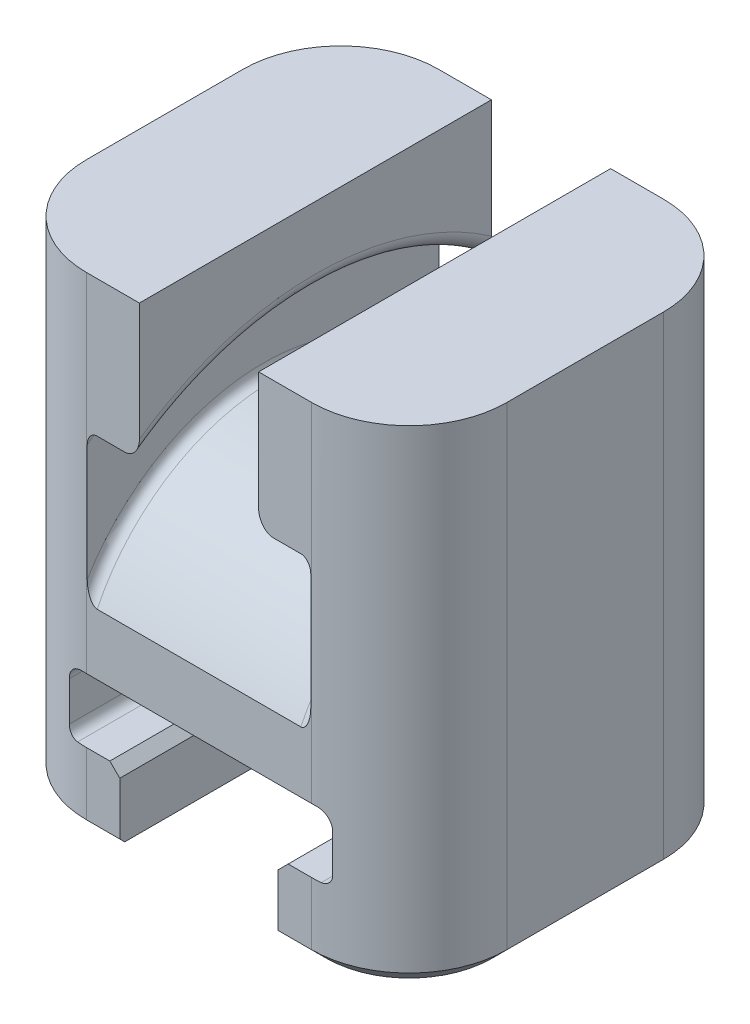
ISO-10303-21;
HEADER;
FILE_DESCRIPTION(('STEP AP214'),'2;1');
FILE_NAME('part.step','',(''),(''),'','','');
FILE_SCHEMA(('AUTOMOTIVE_DESIGN { 1 0 10303 214 1 1 1 1 }'));
ENDSEC;
DATA;
#1=APPLICATION_CONTEXT('core data for automotive mechanical design processes');
#2=APPLICATION_PROTOCOL_DEFINITION('international standard','automotive_design',2000,#1);
#3=PRODUCT_CONTEXT('',#1,'mechanical');
#4=PRODUCT('Part','Part','',(#3));
#5=PRODUCT_RELATED_PRODUCT_CATEGORY('part','',(#4));
#6=PRODUCT_DEFINITION_FORMATION('','',#4);
#7=PRODUCT_DEFINITION_CONTEXT('part definition',#1,'design');
#8=PRODUCT_DEFINITION('design','',#6,#7);
#9=PRODUCT_DEFINITION_SHAPE('','',#8);
#10=(LENGTH_UNIT() NAMED_UNIT(*) SI_UNIT(.MILLI.,.METRE.));
#11=(NAMED_UNIT(*) PLANE_ANGLE_UNIT() SI_UNIT($,.RADIAN.));
#12=(NAMED_UNIT(*) SI_UNIT($,.STERADIAN.) SOLID_ANGLE_UNIT());
#13=UNCERTAINTY_MEASURE_WITH_UNIT(LENGTH_MEASURE(1.E-05),#10,'distance_accuracy_value','');
#14=(GEOMETRIC_REPRESENTATION_CONTEXT(3) GLOBAL_UNCERTAINTY_ASSIGNED_CONTEXT((#13)) GLOBAL_UNIT_ASSIGNED_CONTEXT((#10,
#11,#12)) REPRESENTATION_CONTEXT('',''));
#15=CARTESIAN_POINT('',(0.,0.,0.));
#16=DIRECTION('',(0.,0.,1.));
#17=DIRECTION('',(1.,0.,0.));
#18=AXIS2_PLACEMENT_3D('',#15,#16,#17);
#19=CARTESIAN_POINT('',(10.75,19.,9.));
#20=DIRECTION('',(0.,0.,-1.));
#21=DIRECTION('',(0.,1.,0.));
#22=AXIS2_PLACEMENT_3D('',#19,#20,#21);
#23=PLANE('',#22);
#24=DIRECTION('',(0.,1.,0.));
#25=VECTOR('',#24,1.);
#26=CARTESIAN_POINT('',(4.0513,-2.0376,9.));
#27=LINE('',#26,#25);
#28=CARTESIAN_POINT('',(4.0513,-5.23800000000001,9.));
#29=VERTEX_POINT('',#28);
#30=CARTESIAN_POINT('',(4.0513,-2.5456,9.));
#31=VERTEX_POINT('',#30);
#32=EDGE_CURVE('E763',#29,#31,#27,.T.);
#33=ORIENTED_EDGE('',*,*,#32,.F.);
#34=DIRECTION('',(1.,0.,0.));
#35=VECTOR('',#34,1.);
#36=CARTESIAN_POINT('',(10.75,-5.23800000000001,9.));
#37=LINE('',#36,#35);
#38=CARTESIAN_POINT('',(5.75,-5.23800000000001,9.));
#39=VERTEX_POINT('',#38);
#40=EDGE_CURVE('E765',#29,#39,#37,.T.);
#41=ORIENTED_EDGE('',*,*,#40,.T.);
#42=DIRECTION('',(0.,-1.,0.));
#43=VECTOR('',#42,1.);
#44=CARTESIAN_POINT('',(5.75,19.,9.));
#45=LINE('',#44,#43);
#46=CARTESIAN_POINT('',(5.75,-2.0376,9.));
#47=VERTEX_POINT('',#46);
#48=EDGE_CURVE('E437',#39,#47,#45,.F.);
#49=ORIENTED_EDGE('',*,*,#48,.T.);
#50=DIRECTION('',(1.,0.,0.));
#51=VECTOR('',#50,1.);
#52=CARTESIAN_POINT('',(6.731,-2.0376,9.));
#53=LINE('',#52,#51);
#54=CARTESIAN_POINT('',(4.5593,-2.0376,9.));
#55=VERTEX_POINT('',#54);
#56=EDGE_CURVE('E772',#55,#47,#53,.T.);
#57=ORIENTED_EDGE('',*,*,#56,.F.);
#58=DIRECTION('',(0.707106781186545,0.70710678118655,0.));
#59=VECTOR('',#58,1.);
#60=CARTESIAN_POINT('',(4.5593,-2.0376,9.));
#61=LINE('',#60,#59);
#62=EDGE_CURVE('E768',#55,#31,#61,.F.);
#63=ORIENTED_EDGE('',*,*,#62,.T.);
#64=EDGE_LOOP('',(#33,#41,#49,#57,#63));
#65=FACE_BOUND('',#64,.T.);
#66=ADVANCED_FACE('F39',(#65),#23,.F.);
#67=DIRECTION('',(-1.,0.,0.));
#68=VECTOR('',#67,1.);
#69=CARTESIAN_POINT('',(-18.4382991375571,12.024990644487,9.));
#70=LINE('',#69,#68);
#71=CARTESIAN_POINT('',(-5.207,12.024990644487,9.));
#72=VERTEX_POINT('',#71);
#73=CARTESIAN_POINT('',(-3.81,12.024990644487,9.));
#74=VERTEX_POINT('',#73);
#75=EDGE_CURVE('E870',#72,#74,#70,.F.);
#76=ORIENTED_EDGE('',*,*,#75,.T.);
#77=CARTESIAN_POINT('',(-3.81,12.024990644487,9.));
#78=CARTESIAN_POINT('',(-3.79153121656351,12.0249884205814,9.));
#79=CARTESIAN_POINT('',(-3.77307276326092,12.0258300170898,9.));
#80=CARTESIAN_POINT('',(-3.73631591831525,12.0291715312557,9.));
#81=CARTESIAN_POINT('',(-3.71801744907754,12.0316705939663,9.));
#82=CARTESIAN_POINT('',(-3.66379196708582,12.0415658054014,9.));
#83=CARTESIAN_POINT('',(-3.62827751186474,12.0513608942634,9.));
#84=CARTESIAN_POINT('',(-3.55949565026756,12.0767382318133,9.));
#85=CARTESIAN_POINT('',(-3.52622458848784,12.0923107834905,9.));
#86=CARTESIAN_POINT('',(-3.462481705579,12.1284518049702,9.));
#87=CARTESIAN_POINT('',(-3.4320137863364,12.1490270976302,9.));
#88=CARTESIAN_POINT('',(-3.37221656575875,12.1959822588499,9.));
#89=CARTESIAN_POINT('',(-3.34313725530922,12.2226784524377,9.));
#90=CARTESIAN_POINT('',(-3.28900474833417,12.2798532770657,9.));
#91=CARTESIAN_POINT('',(-3.26395247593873,12.3103327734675,9.));
#92=CARTESIAN_POINT('',(-3.21355966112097,12.3803627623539,9.));
#93=CARTESIAN_POINT('',(-3.18908108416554,12.420533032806,9.));
#94=CARTESIAN_POINT('',(-3.1459676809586,12.5039163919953,9.));
#95=CARTESIAN_POINT('',(-3.12733967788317,12.5471329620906,9.));
#96=CARTESIAN_POINT('',(-3.09294028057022,12.6440064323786,9.));
#97=CARTESIAN_POINT('',(-3.07837534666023,12.6980921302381,9.));
#98=CARTESIAN_POINT('',(-3.05747874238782,12.8077524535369,9.));
#99=CARTESIAN_POINT('',(-3.05113455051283,12.8633246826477,9.));
#100=CARTESIAN_POINT('',(-3.04830193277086,12.93408264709,9.));
#101=CARTESIAN_POINT('',(-3.04800002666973,12.9491639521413,9.));
#102=CARTESIAN_POINT('',(-3.048,12.9642402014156,9.));
#103=B_SPLINE_CURVE_WITH_KNOTS('',3,(#77,#78,#79,#80,#81,#82,#83,#84,#85,#86,#87,#88,#89,#90,
#91,#92,#93,#94,#95,#96,#97,#98,#99,#100,#101,#102),.UNSPECIFIED.,.F.,.F.,(4,2,2,2,2,2,2,2,2,2,
2,2,4),(0.,0.0553673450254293,0.110706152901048,0.220622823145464,0.33035583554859,
0.440239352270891,0.558232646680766,0.676252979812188,0.81685449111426,0.957619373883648,
1.12500517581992,1.29213572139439,1.33737538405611),.UNSPECIFIED.);
#104=CARTESIAN_POINT('',(-3.048,12.9642402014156,9.));
#105=VERTEX_POINT('',#104);
#106=EDGE_CURVE('E547',#74,#105,#103,.T.);
#107=ORIENTED_EDGE('',*,*,#106,.T.);
#108=DIRECTION('',(0.,1.,0.));
#109=VECTOR('',#108,1.);
#110=CARTESIAN_POINT('',(-3.048,19.,9.));
#111=LINE('',#110,#109);
#112=CARTESIAN_POINT('',(-3.048,19.,9.));
#113=VERTEX_POINT('',#112);
#114=EDGE_CURVE('E864',#105,#113,#111,.T.);
#115=ORIENTED_EDGE('',*,*,#114,.T.);
#116=DIRECTION('',(-1.,0.,0.));
#117=VECTOR('',#116,1.);
#118=CARTESIAN_POINT('',(10.75,19.,9.));
#119=LINE('',#118,#117);
#120=CARTESIAN_POINT('',(-5.75,19.,9.));
#121=VERTEX_POINT('',#120);
#122=EDGE_CURVE('E883',#113,#121,#119,.T.);
#123=ORIENTED_EDGE('',*,*,#122,.T.);
#124=DIRECTION('',(0.,-1.,0.));
#125=VECTOR('',#124,1.);
#126=CARTESIAN_POINT('',(-5.75,19.,9.));
#127=LINE('',#126,#125);
#128=CARTESIAN_POINT('',(-5.75,1.239,9.));
#129=VERTEX_POINT('',#128);
#130=EDGE_CURVE('E432',#121,#129,#127,.T.);
#131=ORIENTED_EDGE('',*,*,#130,.T.);
#132=DIRECTION('',(-1.,0.,0.));
#133=VECTOR('',#132,1.);
#134=CARTESIAN_POINT('',(-6.731,1.239,9.));
#135=LINE('',#134,#133);
#136=CARTESIAN_POINT('',(5.75,1.239,9.));
#137=VERTEX_POINT('',#136);
#138=EDGE_CURVE('E897',#137,#129,#135,.T.);
#139=ORIENTED_EDGE('',*,*,#138,.F.);
#140=DIRECTION('',(0.,-1.,0.));
#141=VECTOR('',#140,1.);
#142=CARTESIAN_POINT('',(5.75,19.,9.));
#143=LINE('',#142,#141);
#144=CARTESIAN_POINT('',(5.75,19.,9.));
#145=VERTEX_POINT('',#144);
#146=EDGE_CURVE('E435',#137,#145,#143,.F.);
#147=ORIENTED_EDGE('',*,*,#146,.T.);
#148=CARTESIAN_POINT('',(3.048,19.,9.));
#149=VERTEX_POINT('',#148);
#150=EDGE_CURVE('E885',#145,#149,#119,.T.);
#151=ORIENTED_EDGE('',*,*,#150,.T.);
#152=DIRECTION('',(0.,-1.,0.));
#153=VECTOR('',#152,1.);
#154=CARTESIAN_POINT('',(3.048,19.,9.));
#155=LINE('',#154,#153);
#156=CARTESIAN_POINT('',(3.048,12.9642402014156,9.));
#157=VERTEX_POINT('',#156);
#158=EDGE_CURVE('E356',#149,#157,#155,.T.);
#159=ORIENTED_EDGE('',*,*,#158,.T.);
#160=CARTESIAN_POINT('',(3.048,12.9642402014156,9.));
#161=CARTESIAN_POINT('',(3.04802207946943,12.8998001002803,9.));
#162=CARTESIAN_POINT('',(3.05352115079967,12.8352931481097,9.));
#163=CARTESIAN_POINT('',(3.07559586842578,12.7075855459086,9.));
#164=CARTESIAN_POINT('',(3.09227550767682,12.644402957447,9.));
#165=CARTESIAN_POINT('',(3.136136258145,12.5239962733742,9.));
#166=CARTESIAN_POINT('',(3.16297149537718,12.4666474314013,9.));
#167=CARTESIAN_POINT('',(3.22715851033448,12.3583608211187,9.));
#168=CARTESIAN_POINT('',(3.26446101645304,12.3073945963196,9.));
#169=CARTESIAN_POINT('',(3.33522630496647,12.2302146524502,9.));
#170=CARTESIAN_POINT('',(3.36586349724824,12.2013959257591,9.));
#171=CARTESIAN_POINT('',(3.4314604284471,12.1490917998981,9.));
#172=CARTESIAN_POINT('',(3.46642038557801,12.1256066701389,9.));
#173=CARTESIAN_POINT('',(3.5403389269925,12.0850940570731,9.));
#174=CARTESIAN_POINT('',(3.57933022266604,12.0681256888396,9.));
#175=CARTESIAN_POINT('',(3.65985732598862,12.0422144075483,9.));
#176=CARTESIAN_POINT('',(3.70138549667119,12.0332485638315,9.));
#177=CARTESIAN_POINT('',(3.75439026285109,12.0274253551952,9.));
#178=CARTESIAN_POINT('',(3.76549949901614,12.0265125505,9.));
#179=CARTESIAN_POINT('',(3.787737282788,12.0252961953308,9.));
#180=CARTESIAN_POINT('',(3.79886578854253,12.0249918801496,9.));
#181=CARTESIAN_POINT('',(3.81,12.024990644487,9.));
#182=B_SPLINE_CURVE_WITH_KNOTS('',3,(#160,#161,#162,#163,#164,#165,#166,#167,#168,#169,#170,
#171,#172,#173,#174,#175,#176,#177,#178,#179,#180,#181),.UNSPECIFIED.,.F.,.F.,(4,2,2,2,2,2,2,2,
2,2,4),(0.,0.193207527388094,0.388237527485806,0.577148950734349,0.765185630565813,
0.890895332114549,1.01661138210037,1.14344231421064,1.26990864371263,1.30333779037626,
1.33672489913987),.UNSPECIFIED.);
#183=CARTESIAN_POINT('',(3.81,12.024990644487,9.));
#184=VERTEX_POINT('',#183);
#185=EDGE_CURVE('E555',#157,#184,#182,.T.);
#186=ORIENTED_EDGE('',*,*,#185,.T.);
#187=DIRECTION('',(-1.,0.,0.));
#188=VECTOR('',#187,1.);
#189=CARTESIAN_POINT('',(-18.4382991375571,12.024990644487,9.));
#190=LINE('',#189,#188);
#191=CARTESIAN_POINT('',(5.207,12.024990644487,9.));
#192=VERTEX_POINT('',#191);
#193=EDGE_CURVE('E708',#184,#192,#190,.F.);
#194=ORIENTED_EDGE('',*,*,#193,.T.);
#195=CARTESIAN_POINT('',(5.207,12.024990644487,9.));
#196=CARTESIAN_POINT('',(5.23152293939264,12.0250352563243,9.));
#197=CARTESIAN_POINT('',(5.25600696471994,12.0227759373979,9.));
#198=CARTESIAN_POINT('',(5.30406370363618,12.0140200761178,9.));
#199=CARTESIAN_POINT('',(5.32764090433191,12.0075483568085,9.));
#200=CARTESIAN_POINT('',(5.3733189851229,11.9907432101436,9.));
#201=CARTESIAN_POINT('',(5.39542201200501,11.9804155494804,9.));
#202=CARTESIAN_POINT('',(5.43775485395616,11.9564271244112,9.));
#203=CARTESIAN_POINT('',(5.45798228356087,11.9427621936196,9.));
#204=CARTESIAN_POINT('',(5.49755820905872,11.9116364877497,9.));
#205=CARTESIAN_POINT('',(5.51675179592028,11.893979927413,9.));
#206=CARTESIAN_POINT('',(5.55246962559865,11.856164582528,9.));
#207=CARTESIAN_POINT('',(5.56899316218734,11.8360051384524,9.));
#208=CARTESIAN_POINT('',(5.60219658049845,11.7897459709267,9.));
#209=CARTESIAN_POINT('',(5.6183149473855,11.7632438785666,9.));
#210=CARTESIAN_POINT('',(5.64676001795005,11.7082716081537,9.));
#211=CARTESIAN_POINT('',(5.65908282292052,11.6797994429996,9.));
#212=CARTESIAN_POINT('',(5.68220623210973,11.615446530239,9.));
#213=CARTESIAN_POINT('',(5.69215321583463,11.5792592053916,9.));
#214=CARTESIAN_POINT('',(5.70679621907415,11.5058823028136,9.));
#215=CARTESIAN_POINT('',(5.71149693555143,11.4686936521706,9.));
#216=CARTESIAN_POINT('',(5.71454849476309,11.4156388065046,9.));
#217=CARTESIAN_POINT('',(5.71499923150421,11.399874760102,9.));
#218=CARTESIAN_POINT('',(5.715,11.3841180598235,9.));
#219=B_SPLINE_CURVE_WITH_KNOTS('',3,(#195,#196,#197,#198,#199,#200,#201,#202,#203,#204,#205,
#206,#207,#208,#209,#210,#211,#212,#213,#214,#215,#216,#217,#218),.UNSPECIFIED.,.F.,.F.,(4,2,2,
2,2,2,2,2,2,2,2,4),(0.,0.0734035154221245,0.146378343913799,0.219244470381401,0.292202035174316,
0.370152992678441,0.448124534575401,0.540843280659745,0.633656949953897,0.745829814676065,
0.857902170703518,0.905184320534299),.UNSPECIFIED.);
#220=CARTESIAN_POINT('',(5.715,11.3841180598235,9.));
#221=VERTEX_POINT('',#220);
#222=EDGE_CURVE('E572',#192,#221,#219,.T.);
#223=ORIENTED_EDGE('',*,*,#222,.T.);
#224=DIRECTION('',(0.,-1.,0.));
#225=VECTOR('',#224,1.);
#226=CARTESIAN_POINT('',(5.715,19.,9.));
#227=LINE('',#226,#225);
#228=CARTESIAN_POINT('',(5.715,5.42384218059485,9.));
#229=VERTEX_POINT('',#228);
#230=EDGE_CURVE('E866',#221,#229,#227,.T.);
#231=ORIENTED_EDGE('',*,*,#230,.T.);
#232=CARTESIAN_POINT('',(5.715,5.42384218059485,9.));
#233=CARTESIAN_POINT('',(5.7149575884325,5.36996627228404,9.));
#234=CARTESIAN_POINT('',(5.71271442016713,5.31608928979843,9.));
#235=CARTESIAN_POINT('',(5.7038114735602,5.20853064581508,9.));
#236=CARTESIAN_POINT('',(5.69713778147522,5.15485013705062,9.));
#237=CARTESIAN_POINT('',(5.67941412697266,5.04855775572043,9.));
#238=CARTESIAN_POINT('',(5.66839160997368,4.99594131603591,9.));
#239=CARTESIAN_POINT('',(5.64163994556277,4.89197236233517,9.));
#240=CARTESIAN_POINT('',(5.6259183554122,4.84061796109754,9.));
#241=CARTESIAN_POINT('',(5.59645123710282,4.76028253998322,9.));
#242=CARTESIAN_POINT('',(5.58447657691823,4.73065020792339,9.));
#243=CARTESIAN_POINT('',(5.55820595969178,4.6722466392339,9.));
#244=CARTESIAN_POINT('',(5.54389927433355,4.64348014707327,9.));
#245=CARTESIAN_POINT('',(5.50861862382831,4.58033927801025,9.));
#246=CARTESIAN_POINT('',(5.48687373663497,4.54638964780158,9.));
#247=CARTESIAN_POINT('',(5.43782124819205,4.4827931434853,9.));
#248=CARTESIAN_POINT('',(5.41055877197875,4.45311450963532,9.));
#249=CARTESIAN_POINT('',(5.36756214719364,4.41794286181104,9.));
#250=CARTESIAN_POINT('',(5.35490894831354,4.40872284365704,9.));
#251=CARTESIAN_POINT('',(5.32841860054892,4.39214235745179,9.));
#252=CARTESIAN_POINT('',(5.31458226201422,4.38478063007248,9.));
#253=CARTESIAN_POINT('',(5.28789688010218,4.37339526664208,9.));
#254=CARTESIAN_POINT('',(5.27518897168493,4.36904508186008,9.));
#255=CARTESIAN_POINT('',(5.24923496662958,4.36255142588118,9.));
#256=CARTESIAN_POINT('',(5.23599042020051,4.36040201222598,9.));
#257=CARTESIAN_POINT('',(5.21745614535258,4.35908223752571,9.));
#258=CARTESIAN_POINT('',(5.21222716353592,4.3588951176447,9.));
#259=CARTESIAN_POINT('',(5.207,4.35889894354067,9.));
#260=B_SPLINE_CURVE_WITH_KNOTS('',3,(#232,#233,#234,#235,#236,#237,#238,#239,#240,#241,#242,
#243,#244,#245,#246,#247,#248,#249,#250,#251,#252,#253,#254,#255,#256,#257,#258,#259),
.UNSPECIFIED.,.F.,.F.,(4,2,2,2,2,2,2,2,2,2,2,2,2,4),(0.,0.161587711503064,0.323685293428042,
0.48477583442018,0.645608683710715,0.741417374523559,0.837679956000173,0.958320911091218,
1.07801242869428,1.12486392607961,1.17168358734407,1.21181783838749,1.25184343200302,
1.26752735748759),.UNSPECIFIED.);
#261=CARTESIAN_POINT('',(5.207,4.35889894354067,9.));
#262=VERTEX_POINT('',#261);
#263=EDGE_CURVE('E583',#229,#262,#260,.T.);
#264=ORIENTED_EDGE('',*,*,#263,.T.);
#265=DIRECTION('',(-1.,0.,0.));
#266=VECTOR('',#265,1.);
#267=CARTESIAN_POINT('',(-18.4382991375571,4.35889894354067,9.));
#268=LINE('',#267,#266);
#269=CARTESIAN_POINT('',(-5.207,4.35889894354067,9.));
#270=VERTEX_POINT('',#269);
#271=EDGE_CURVE('E876',#262,#270,#268,.T.);
#272=ORIENTED_EDGE('',*,*,#271,.T.);
#273=CARTESIAN_POINT('',(-5.207,4.35889894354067,9.));
#274=CARTESIAN_POINT('',(-5.22076539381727,4.35886057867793,9.));
#275=CARTESIAN_POINT('',(-5.2344792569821,4.36018069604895,9.));
#276=CARTESIAN_POINT('',(-5.26130613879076,4.36517846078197,9.));
#277=CARTESIAN_POINT('',(-5.27442442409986,4.36882735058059,9.));
#278=CARTESIAN_POINT('',(-5.30318688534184,4.37933485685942,9.));
#279=CARTESIAN_POINT('',(-5.31861382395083,4.38677734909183,9.));
#280=CARTESIAN_POINT('',(-5.34812778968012,4.40404438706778,9.));
#281=CARTESIAN_POINT('',(-5.362207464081,4.41388106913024,9.));
#282=CARTESIAN_POINT('',(-5.39760699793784,4.44210351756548,9.));
#283=CARTESIAN_POINT('',(-5.41777059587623,4.46192297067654,9.));
#284=CARTESIAN_POINT('',(-5.45502999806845,4.50421558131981,9.));
#285=CARTESIAN_POINT('',(-5.47211910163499,4.52669436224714,9.));
#286=CARTESIAN_POINT('',(-5.50381693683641,4.57333846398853,9.));
#287=CARTESIAN_POINT('',(-5.51842390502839,4.59750496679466,9.));
#288=CARTESIAN_POINT('',(-5.54557469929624,4.64697932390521,9.));
#289=CARTESIAN_POINT('',(-5.55811651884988,4.67228825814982,9.));
#290=CARTESIAN_POINT('',(-5.59320362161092,4.74961326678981,9.));
#291=CARTESIAN_POINT('',(-5.61309199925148,4.80283924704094,9.));
#292=CARTESIAN_POINT('',(-5.6447241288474,4.90315338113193,9.));
#293=CARTESIAN_POINT('',(-5.65723048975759,4.95001325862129,9.));
#294=CARTESIAN_POINT('',(-5.67852279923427,5.04461350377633,9.));
#295=CARTESIAN_POINT('',(-5.68730566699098,5.0923545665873,9.));
#296=CARTESIAN_POINT('',(-5.70117413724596,5.18730978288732,9.));
#297=CARTESIAN_POINT('',(-5.70633564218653,5.2345129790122,9.));
#298=CARTESIAN_POINT('',(-5.71323333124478,5.32909028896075,9.));
#299=CARTESIAN_POINT('',(-5.71497517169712,5.37646399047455,9.));
#300=CARTESIAN_POINT('',(-5.715,5.42384218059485,9.));
#301=B_SPLINE_CURVE_WITH_KNOTS('',3,(#273,#274,#275,#276,#277,#278,#279,#280,#281,#282,#283,
#284,#285,#286,#287,#288,#289,#290,#291,#292,#293,#294,#295,#296,#297,#298,#299,#300),
.UNSPECIFIED.,.F.,.F.,(4,2,2,2,2,2,2,2,2,2,2,2,2,4),(0.,0.041149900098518,0.0818012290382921,
0.132899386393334,0.184262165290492,0.268606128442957,0.353131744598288,0.437717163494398,
0.522384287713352,0.692379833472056,0.837740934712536,0.983222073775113,1.12555471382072,
1.26765172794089),.UNSPECIFIED.);
#302=CARTESIAN_POINT('',(-5.715,5.42384218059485,9.));
#303=VERTEX_POINT('',#302);
#304=EDGE_CURVE('E592',#270,#303,#301,.T.);
#305=ORIENTED_EDGE('',*,*,#304,.T.);
#306=DIRECTION('',(0.,1.,0.));
#307=VECTOR('',#306,1.);
#308=CARTESIAN_POINT('',(-5.715,19.,9.));
#309=LINE('',#308,#307);
#310=CARTESIAN_POINT('',(-5.715,11.3841180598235,9.));
#311=VERTEX_POINT('',#310);
#312=EDGE_CURVE('E873',#303,#311,#309,.T.);
#313=ORIENTED_EDGE('',*,*,#312,.T.);
#314=CARTESIAN_POINT('',(-5.715,11.3841180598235,9.));
#315=CARTESIAN_POINT('',(-5.71498570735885,11.4269990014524,9.));
#316=CARTESIAN_POINT('',(-5.71165439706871,11.4699656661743,9.));
#317=CARTESIAN_POINT('',(-5.6980862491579,11.5550691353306,9.));
#318=CARTESIAN_POINT('',(-5.68780477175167,11.5971987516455,9.));
#319=CARTESIAN_POINT('',(-5.66223494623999,11.672618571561,9.));
#320=CARTESIAN_POINT('',(-5.64798499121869,11.7062587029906,9.));
#321=CARTESIAN_POINT('',(-5.6142370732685,11.7707398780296,9.));
#322=CARTESIAN_POINT('',(-5.59475302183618,11.8015880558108,9.));
#323=CARTESIAN_POINT('',(-5.55481289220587,11.853616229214,9.));
#324=CARTESIAN_POINT('',(-5.5352864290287,11.875508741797,9.));
#325=CARTESIAN_POINT('',(-5.49290974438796,11.915828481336,9.));
#326=CARTESIAN_POINT('',(-5.47006186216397,11.9342581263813,9.));
#327=CARTESIAN_POINT('',(-5.42503172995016,11.9642724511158,9.));
#328=CARTESIAN_POINT('',(-5.40325712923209,11.9764677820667,9.));
#329=CARTESIAN_POINT('',(-5.35798899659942,11.9970486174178,9.));
#330=CARTESIAN_POINT('',(-5.33449832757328,12.0054403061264,9.));
#331=CARTESIAN_POINT('',(-5.29359905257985,12.0160723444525,9.));
#332=CARTESIAN_POINT('',(-5.27646766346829,12.0194010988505,9.));
#333=CARTESIAN_POINT('',(-5.24189568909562,12.0238669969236,9.));
#334=CARTESIAN_POINT('',(-5.22445466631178,12.0250007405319,9.));
#335=CARTESIAN_POINT('',(-5.207,12.024990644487,9.));
#336=B_SPLINE_CURVE_WITH_KNOTS('',3,(#314,#315,#316,#317,#318,#319,#320,#321,#322,#323,#324,
#325,#326,#327,#328,#329,#330,#331,#332,#333,#334,#335),.UNSPECIFIED.,.F.,.F.,(4,2,2,2,2,2,2,2,
2,2,4),(0.,0.128659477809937,0.258153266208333,0.367334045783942,0.47622746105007,
0.563896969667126,0.651505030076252,0.726065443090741,0.800504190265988,0.852726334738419,
0.905029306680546),.UNSPECIFIED.);
#337=EDGE_CURVE('E600',#311,#72,#336,.T.);
#338=ORIENTED_EDGE('',*,*,#337,.T.);
#339=EDGE_LOOP('',(#76,#107,#115,#123,#131,#139,#147,#151,#159,#186,#194,#223,#231,#264,#272,
#305,#313,#338));
#340=FACE_BOUND('',#339,.T.);
#341=ADVANCED_FACE('F568',(#340),#23,.F.);
#342=CARTESIAN_POINT('',(10.75,19.,-9.));
#343=DIRECTION('',(0.,0.,1.));
#344=DIRECTION('',(0.,-1.,0.));
#345=AXIS2_PLACEMENT_3D('',#342,#343,#344);
#346=PLANE('',#345);
#347=DIRECTION('',(0.,-1.,0.));
#348=VECTOR('',#347,1.);
#349=CARTESIAN_POINT('',(-3.048,19.,-9.));
#350=LINE('',#349,#348);
#351=CARTESIAN_POINT('',(-3.048,19.,-9.));
#352=VERTEX_POINT('',#351);
#353=CARTESIAN_POINT('',(-3.048,12.9642402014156,-9.));
#354=VERTEX_POINT('',#353);
#355=EDGE_CURVE('E862',#352,#354,#350,.T.);
#356=ORIENTED_EDGE('',*,*,#355,.T.);
#357=CARTESIAN_POINT('',(-3.048,12.9642402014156,-9.));
#358=CARTESIAN_POINT('',(-3.04802207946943,12.8998001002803,-9.));
#359=CARTESIAN_POINT('',(-3.05352115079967,12.8352931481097,-9.));
#360=CARTESIAN_POINT('',(-3.07559586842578,12.7075855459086,-9.));
#361=CARTESIAN_POINT('',(-3.09227550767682,12.644402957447,-9.));
#362=CARTESIAN_POINT('',(-3.136136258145,12.5239962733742,-9.));
#363=CARTESIAN_POINT('',(-3.16297149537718,12.4666474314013,-9.));
#364=CARTESIAN_POINT('',(-3.22715851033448,12.3583608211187,-9.));
#365=CARTESIAN_POINT('',(-3.26446101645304,12.3073945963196,-9.));
#366=CARTESIAN_POINT('',(-3.33522630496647,12.2302146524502,-9.));
#367=CARTESIAN_POINT('',(-3.36586349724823,12.2013959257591,-9.));
#368=CARTESIAN_POINT('',(-3.4314604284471,12.1490917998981,-9.));
#369=CARTESIAN_POINT('',(-3.46642038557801,12.1256066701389,-9.));
#370=CARTESIAN_POINT('',(-3.5403389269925,12.0850940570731,-9.));
#371=CARTESIAN_POINT('',(-3.57933022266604,12.0681256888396,-9.));
#372=CARTESIAN_POINT('',(-3.65985732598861,12.0422144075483,-9.));
#373=CARTESIAN_POINT('',(-3.70138549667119,12.0332485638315,-9.));
#374=CARTESIAN_POINT('',(-3.75439026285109,12.0274253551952,-9.));
#375=CARTESIAN_POINT('',(-3.76549949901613,12.0265125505,-9.));
#376=CARTESIAN_POINT('',(-3.787737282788,12.0252961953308,-9.));
#377=CARTESIAN_POINT('',(-3.79886578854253,12.0249918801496,-9.));
#378=CARTESIAN_POINT('',(-3.81,12.024990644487,-9.));
#379=B_SPLINE_CURVE_WITH_KNOTS('',3,(#357,#358,#359,#360,#361,#362,#363,#364,#365,#366,#367,
#368,#369,#370,#371,#372,#373,#374,#375,#376,#377,#378),.UNSPECIFIED.,.F.,.F.,(4,2,2,2,2,2,2,2,
2,2,4),(0.,0.193207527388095,0.388237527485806,0.577148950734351,0.765185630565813,
0.890895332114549,1.01661138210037,1.14344231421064,1.26990864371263,1.30333779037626,
1.33672489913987),.UNSPECIFIED.);
#380=CARTESIAN_POINT('',(-3.81,12.024990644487,-9.));
#381=VERTEX_POINT('',#380);
#382=EDGE_CURVE('E538',#354,#381,#379,.T.);
#383=ORIENTED_EDGE('',*,*,#382,.T.);
#384=DIRECTION('',(-1.,0.,0.));
#385=VECTOR('',#384,1.);
#386=CARTESIAN_POINT('',(-18.4382991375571,12.024990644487,-9.));
#387=LINE('',#386,#385);
#388=CARTESIAN_POINT('',(-5.207,12.024990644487,-9.));
#389=VERTEX_POINT('',#388);
#390=EDGE_CURVE('E389',#381,#389,#387,.T.);
#391=ORIENTED_EDGE('',*,*,#390,.T.);
#392=CARTESIAN_POINT('',(-5.207,12.024990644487,-9.));
#393=CARTESIAN_POINT('',(-5.23152293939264,12.0250352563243,-9.));
#394=CARTESIAN_POINT('',(-5.25600696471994,12.0227759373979,-9.));
#395=CARTESIAN_POINT('',(-5.30406370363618,12.0140200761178,-9.));
#396=CARTESIAN_POINT('',(-5.32764090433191,12.0075483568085,-9.));
#397=CARTESIAN_POINT('',(-5.3733189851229,11.9907432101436,-9.));
#398=CARTESIAN_POINT('',(-5.39542201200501,11.9804155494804,-9.));
#399=CARTESIAN_POINT('',(-5.43775485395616,11.9564271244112,-9.));
#400=CARTESIAN_POINT('',(-5.45798228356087,11.9427621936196,-9.));
#401=CARTESIAN_POINT('',(-5.49755820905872,11.9116364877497,-9.));
#402=CARTESIAN_POINT('',(-5.51675179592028,11.893979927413,-9.));
#403=CARTESIAN_POINT('',(-5.55246962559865,11.856164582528,-9.));
#404=CARTESIAN_POINT('',(-5.56899316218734,11.8360051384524,-9.));
#405=CARTESIAN_POINT('',(-5.60219658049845,11.7897459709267,-9.));
#406=CARTESIAN_POINT('',(-5.6183149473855,11.7632438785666,-9.));
#407=CARTESIAN_POINT('',(-5.64676001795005,11.7082716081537,-9.));
#408=CARTESIAN_POINT('',(-5.65908282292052,11.6797994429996,-9.));
#409=CARTESIAN_POINT('',(-5.68220623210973,11.615446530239,-9.));
#410=CARTESIAN_POINT('',(-5.69215321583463,11.5792592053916,-9.));
#411=CARTESIAN_POINT('',(-5.70679621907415,11.5058823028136,-9.));
#412=CARTESIAN_POINT('',(-5.71149693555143,11.4686936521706,-9.));
#413=CARTESIAN_POINT('',(-5.71454849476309,11.4156388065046,-9.));
#414=CARTESIAN_POINT('',(-5.71499923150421,11.399874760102,-9.));
#415=CARTESIAN_POINT('',(-5.715,11.3841180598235,-9.));
#416=B_SPLINE_CURVE_WITH_KNOTS('',3,(#392,#393,#394,#395,#396,#397,#398,#399,#400,#401,#402,
#403,#404,#405,#406,#407,#408,#409,#410,#411,#412,#413,#414,#415),.UNSPECIFIED.,.F.,.F.,(4,2,2,
2,2,2,2,2,2,2,2,4),(0.,0.0734035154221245,0.146378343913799,0.219244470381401,0.292202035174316,
0.370152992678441,0.448124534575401,0.540843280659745,0.633656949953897,0.745829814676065,
0.857902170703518,0.905184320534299),.UNSPECIFIED.);
#417=CARTESIAN_POINT('',(-5.715,11.3841180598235,-9.));
#418=VERTEX_POINT('',#417);
#419=EDGE_CURVE('E607',#389,#418,#416,.T.);
#420=ORIENTED_EDGE('',*,*,#419,.T.);
#421=DIRECTION('',(0.,-1.,0.));
#422=VECTOR('',#421,1.);
#423=CARTESIAN_POINT('',(-5.715,19.,-9.));
#424=LINE('',#423,#422);
#425=CARTESIAN_POINT('',(-5.715,5.42384218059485,-9.));
#426=VERTEX_POINT('',#425);
#427=EDGE_CURVE('E386',#418,#426,#424,.T.);
#428=ORIENTED_EDGE('',*,*,#427,.T.);
#429=CARTESIAN_POINT('',(-5.715,5.42384218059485,-9.));
#430=CARTESIAN_POINT('',(-5.7149575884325,5.36996627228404,-9.));
#431=CARTESIAN_POINT('',(-5.71271442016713,5.31608928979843,-9.));
#432=CARTESIAN_POINT('',(-5.7038114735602,5.20853064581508,-9.));
#433=CARTESIAN_POINT('',(-5.69713778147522,5.15485013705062,-9.));
#434=CARTESIAN_POINT('',(-5.67941412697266,5.04855775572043,-9.));
#435=CARTESIAN_POINT('',(-5.66839160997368,4.99594131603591,-9.));
#436=CARTESIAN_POINT('',(-5.64163994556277,4.89197236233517,-9.));
#437=CARTESIAN_POINT('',(-5.6259183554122,4.84061796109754,-9.));
#438=CARTESIAN_POINT('',(-5.59645123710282,4.76028253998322,-9.));
#439=CARTESIAN_POINT('',(-5.58447657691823,4.73065020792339,-9.));
#440=CARTESIAN_POINT('',(-5.55820595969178,4.6722466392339,-9.));
#441=CARTESIAN_POINT('',(-5.54389927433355,4.64348014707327,-9.));
#442=CARTESIAN_POINT('',(-5.50861862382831,4.58033927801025,-9.));
#443=CARTESIAN_POINT('',(-5.48687373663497,4.54638964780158,-9.));
#444=CARTESIAN_POINT('',(-5.43782124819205,4.4827931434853,-9.));
#445=CARTESIAN_POINT('',(-5.41055877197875,4.45311450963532,-9.));
#446=CARTESIAN_POINT('',(-5.36756214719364,4.41794286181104,-9.));
#447=CARTESIAN_POINT('',(-5.35490894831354,4.40872284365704,-9.));
#448=CARTESIAN_POINT('',(-5.32841860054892,4.39214235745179,-9.));
#449=CARTESIAN_POINT('',(-5.31458226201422,4.38478063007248,-9.));
#450=CARTESIAN_POINT('',(-5.28789688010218,4.37339526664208,-9.));
#451=CARTESIAN_POINT('',(-5.27518897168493,4.36904508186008,-9.));
#452=CARTESIAN_POINT('',(-5.24923496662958,4.36255142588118,-9.));
#453=CARTESIAN_POINT('',(-5.23599042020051,4.36040201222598,-9.));
#454=CARTESIAN_POINT('',(-5.21745614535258,4.35908223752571,-9.));
#455=CARTESIAN_POINT('',(-5.21222716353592,4.3588951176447,-9.));
#456=CARTESIAN_POINT('',(-5.207,4.35889894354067,-9.));
#457=B_SPLINE_CURVE_WITH_KNOTS('',3,(#429,#430,#431,#432,#433,#434,#435,#436,#437,#438,#439,
#440,#441,#442,#443,#444,#445,#446,#447,#448,#449,#450,#451,#452,#453,#454,#455,#456),
.UNSPECIFIED.,.F.,.F.,(4,2,2,2,2,2,2,2,2,2,2,2,2,4),(0.,0.161587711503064,0.323685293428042,
0.48477583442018,0.645608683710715,0.741417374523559,0.837679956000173,0.958320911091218,
1.07801242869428,1.12486392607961,1.17168358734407,1.21181783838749,1.25184343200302,
1.26752735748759),.UNSPECIFIED.);
#458=CARTESIAN_POINT('',(-5.207,4.35889894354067,-9.));
#459=VERTEX_POINT('',#458);
#460=EDGE_CURVE('E625',#426,#459,#457,.T.);
#461=ORIENTED_EDGE('',*,*,#460,.T.);
#462=DIRECTION('',(-1.,0.,0.));
#463=VECTOR('',#462,1.);
#464=CARTESIAN_POINT('',(-18.4382991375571,4.35889894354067,-9.));
#465=LINE('',#464,#463);
#466=CARTESIAN_POINT('',(5.207,4.35889894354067,-9.));
#467=VERTEX_POINT('',#466);
#468=EDGE_CURVE('E383',#459,#467,#465,.F.);
#469=ORIENTED_EDGE('',*,*,#468,.T.);
#470=CARTESIAN_POINT('',(5.207,4.35889894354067,-9.));
#471=CARTESIAN_POINT('',(5.22076539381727,4.35886057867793,-9.));
#472=CARTESIAN_POINT('',(5.2344792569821,4.36018069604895,-9.));
#473=CARTESIAN_POINT('',(5.26130613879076,4.36517846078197,-9.));
#474=CARTESIAN_POINT('',(5.27442442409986,4.36882735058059,-9.));
#475=CARTESIAN_POINT('',(5.30318688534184,4.37933485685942,-9.));
#476=CARTESIAN_POINT('',(5.31861382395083,4.38677734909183,-9.));
#477=CARTESIAN_POINT('',(5.34812778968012,4.40404438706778,-9.));
#478=CARTESIAN_POINT('',(5.362207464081,4.41388106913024,-9.));
#479=CARTESIAN_POINT('',(5.39760699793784,4.44210351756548,-9.));
#480=CARTESIAN_POINT('',(5.41777059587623,4.46192297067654,-9.));
#481=CARTESIAN_POINT('',(5.45502999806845,4.50421558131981,-9.));
#482=CARTESIAN_POINT('',(5.47211910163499,4.52669436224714,-9.));
#483=CARTESIAN_POINT('',(5.50381693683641,4.57333846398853,-9.));
#484=CARTESIAN_POINT('',(5.51842390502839,4.59750496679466,-9.));
#485=CARTESIAN_POINT('',(5.54557469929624,4.64697932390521,-9.));
#486=CARTESIAN_POINT('',(5.55811651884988,4.67228825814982,-9.));
#487=CARTESIAN_POINT('',(5.59320362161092,4.74961326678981,-9.));
#488=CARTESIAN_POINT('',(5.61309199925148,4.80283924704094,-9.));
#489=CARTESIAN_POINT('',(5.6447241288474,4.90315338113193,-9.));
#490=CARTESIAN_POINT('',(5.65723048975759,4.95001325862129,-9.));
#491=CARTESIAN_POINT('',(5.67852279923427,5.04461350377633,-9.));
#492=CARTESIAN_POINT('',(5.68730566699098,5.0923545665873,-9.));
#493=CARTESIAN_POINT('',(5.70117413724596,5.18730978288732,-9.));
#494=CARTESIAN_POINT('',(5.70633564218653,5.2345129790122,-9.));
#495=CARTESIAN_POINT('',(5.71323333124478,5.32909028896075,-9.));
#496=CARTESIAN_POINT('',(5.71497517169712,5.37646399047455,-9.));
#497=CARTESIAN_POINT('',(5.715,5.42384218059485,-9.));
#498=B_SPLINE_CURVE_WITH_KNOTS('',3,(#470,#471,#472,#473,#474,#475,#476,#477,#478,#479,#480,
#481,#482,#483,#484,#485,#486,#487,#488,#489,#490,#491,#492,#493,#494,#495,#496,#497),
.UNSPECIFIED.,.F.,.F.,(4,2,2,2,2,2,2,2,2,2,2,2,2,4),(0.,0.041149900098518,0.0818012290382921,
0.132899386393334,0.184262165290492,0.268606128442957,0.353131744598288,0.437717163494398,
0.522384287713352,0.692379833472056,0.837740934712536,0.983222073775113,1.12555471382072,
1.26765172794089),.UNSPECIFIED.);
#499=CARTESIAN_POINT('',(5.715,5.42384218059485,-9.));
#500=VERTEX_POINT('',#499);
#501=EDGE_CURVE('E647',#467,#500,#498,.T.);
#502=ORIENTED_EDGE('',*,*,#501,.T.);
#503=DIRECTION('',(0.,1.,0.));
#504=VECTOR('',#503,1.);
#505=CARTESIAN_POINT('',(5.715,19.,-9.));
#506=LINE('',#505,#504);
#507=CARTESIAN_POINT('',(5.715,11.3841180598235,-9.));
#508=VERTEX_POINT('',#507);
#509=EDGE_CURVE('E375',#500,#508,#506,.T.);
#510=ORIENTED_EDGE('',*,*,#509,.T.);
#511=CARTESIAN_POINT('',(5.715,11.3841180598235,-9.));
#512=CARTESIAN_POINT('',(5.71498570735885,11.4269990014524,-9.));
#513=CARTESIAN_POINT('',(5.71165439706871,11.4699656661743,-9.));
#514=CARTESIAN_POINT('',(5.6980862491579,11.5550691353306,-9.));
#515=CARTESIAN_POINT('',(5.68780477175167,11.5971987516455,-9.));
#516=CARTESIAN_POINT('',(5.66223494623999,11.672618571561,-9.));
#517=CARTESIAN_POINT('',(5.64798499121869,11.7062587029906,-9.));
#518=CARTESIAN_POINT('',(5.6142370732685,11.7707398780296,-9.));
#519=CARTESIAN_POINT('',(5.59475302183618,11.8015880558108,-9.));
#520=CARTESIAN_POINT('',(5.55481289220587,11.853616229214,-9.));
#521=CARTESIAN_POINT('',(5.5352864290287,11.875508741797,-9.));
#522=CARTESIAN_POINT('',(5.49290974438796,11.915828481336,-9.));
#523=CARTESIAN_POINT('',(5.47006186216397,11.9342581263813,-9.));
#524=CARTESIAN_POINT('',(5.42503172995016,11.9642724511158,-9.));
#525=CARTESIAN_POINT('',(5.40325712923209,11.9764677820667,-9.));
#526=CARTESIAN_POINT('',(5.35798899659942,11.9970486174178,-9.));
#527=CARTESIAN_POINT('',(5.33449832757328,12.0054403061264,-9.));
#528=CARTESIAN_POINT('',(5.29359905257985,12.0160723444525,-9.));
#529=CARTESIAN_POINT('',(5.27646766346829,12.0194010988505,-9.));
#530=CARTESIAN_POINT('',(5.24189568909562,12.0238669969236,-9.));
#531=CARTESIAN_POINT('',(5.22445466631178,12.0250007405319,-9.));
#532=CARTESIAN_POINT('',(5.207,12.024990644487,-9.));
#533=B_SPLINE_CURVE_WITH_KNOTS('',3,(#511,#512,#513,#514,#515,#516,#517,#518,#519,#520,#521,
#522,#523,#524,#525,#526,#527,#528,#529,#530,#531,#532),.UNSPECIFIED.,.F.,.F.,(4,2,2,2,2,2,2,2,
2,2,4),(0.,0.128659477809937,0.258153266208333,0.367334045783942,0.47622746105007,
0.563896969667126,0.651505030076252,0.726065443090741,0.800504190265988,0.852726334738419,
0.905029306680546),.UNSPECIFIED.);
#534=CARTESIAN_POINT('',(5.207,12.024990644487,-9.));
#535=VERTEX_POINT('',#534);
#536=EDGE_CURVE('E639',#508,#535,#533,.T.);
#537=ORIENTED_EDGE('',*,*,#536,.T.);
#538=DIRECTION('',(-1.,0.,0.));
#539=VECTOR('',#538,1.);
#540=CARTESIAN_POINT('',(-18.4382991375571,12.024990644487,-9.));
#541=LINE('',#540,#539);
#542=CARTESIAN_POINT('',(3.81,12.024990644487,-9.));
#543=VERTEX_POINT('',#542);
#544=EDGE_CURVE('E381',#535,#543,#541,.T.);
#545=ORIENTED_EDGE('',*,*,#544,.T.);
#546=CARTESIAN_POINT('',(3.81,12.024990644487,-9.));
#547=CARTESIAN_POINT('',(3.79153121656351,12.0249884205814,-9.));
#548=CARTESIAN_POINT('',(3.77307276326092,12.0258300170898,-9.));
#549=CARTESIAN_POINT('',(3.73631591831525,12.0291715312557,-9.));
#550=CARTESIAN_POINT('',(3.71801744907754,12.0316705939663,-9.));
#551=CARTESIAN_POINT('',(3.66379196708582,12.0415658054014,-9.));
#552=CARTESIAN_POINT('',(3.62827751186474,12.0513608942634,-9.));
#553=CARTESIAN_POINT('',(3.55949565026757,12.0767382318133,-9.));
#554=CARTESIAN_POINT('',(3.52622458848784,12.0923107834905,-9.));
#555=CARTESIAN_POINT('',(3.462481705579,12.1284518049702,-9.));
#556=CARTESIAN_POINT('',(3.4320137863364,12.1490270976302,-9.));
#557=CARTESIAN_POINT('',(3.37221656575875,12.1959822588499,-9.));
#558=CARTESIAN_POINT('',(3.34313725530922,12.2226784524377,-9.));
#559=CARTESIAN_POINT('',(3.28900474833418,12.2798532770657,-9.));
#560=CARTESIAN_POINT('',(3.26395247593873,12.3103327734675,-9.));
#561=CARTESIAN_POINT('',(3.21355966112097,12.3803627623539,-9.));
#562=CARTESIAN_POINT('',(3.18908108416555,12.420533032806,-9.));
#563=CARTESIAN_POINT('',(3.14596768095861,12.5039163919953,-9.));
#564=CARTESIAN_POINT('',(3.12733967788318,12.5471329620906,-9.));
#565=CARTESIAN_POINT('',(3.09294028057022,12.6440064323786,-9.));
#566=CARTESIAN_POINT('',(3.07837534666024,12.6980921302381,-9.));
#567=CARTESIAN_POINT('',(3.05747874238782,12.8077524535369,-9.));
#568=CARTESIAN_POINT('',(3.05113455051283,12.8633246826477,-9.));
#569=CARTESIAN_POINT('',(3.04830193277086,12.93408264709,-9.));
#570=CARTESIAN_POINT('',(3.04800002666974,12.9491639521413,-9.));
#571=CARTESIAN_POINT('',(3.048,12.9642402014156,-9.));
#572=B_SPLINE_CURVE_WITH_KNOTS('',3,(#546,#547,#548,#549,#550,#551,#552,#553,#554,#555,#556,
#557,#558,#559,#560,#561,#562,#563,#564,#565,#566,#567,#568,#569,#570,#571),.UNSPECIFIED.,.F.,
.F.,(4,2,2,2,2,2,2,2,2,2,2,2,4),(0.,0.0553673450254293,0.110706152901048,0.220622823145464,
0.33035583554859,0.440239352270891,0.558232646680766,0.676252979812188,0.81685449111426,
0.957619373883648,1.12500517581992,1.29213572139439,1.33737538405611),.UNSPECIFIED.);
#573=CARTESIAN_POINT('',(3.048,12.9642402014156,-9.));
#574=VERTEX_POINT('',#573);
#575=EDGE_CURVE('E352',#543,#574,#572,.T.);
#576=ORIENTED_EDGE('',*,*,#575,.T.);
#577=DIRECTION('',(0.,1.,0.));
#578=VECTOR('',#577,1.);
#579=CARTESIAN_POINT('',(3.048,19.,-9.));
#580=LINE('',#579,#578);
#581=CARTESIAN_POINT('',(3.048,19.,-9.));
#582=VERTEX_POINT('',#581);
#583=EDGE_CURVE('E345',#574,#582,#580,.T.);
#584=ORIENTED_EDGE('',*,*,#583,.T.);
#585=DIRECTION('',(-1.,0.,0.));
#586=VECTOR('',#585,1.);
#587=CARTESIAN_POINT('',(10.75,19.,-9.));
#588=LINE('',#587,#586);
#589=CARTESIAN_POINT('',(5.75,19.,-9.));
#590=VERTEX_POINT('',#589);
#591=EDGE_CURVE('E349',#590,#582,#588,.T.);
#592=ORIENTED_EDGE('',*,*,#591,.F.);
#593=DIRECTION('',(0.,1.,0.));
#594=VECTOR('',#593,1.);
#595=CARTESIAN_POINT('',(5.75,-6.,-9.));
#596=LINE('',#595,#594);
#597=CARTESIAN_POINT('',(5.75,1.239,-9.));
#598=VERTEX_POINT('',#597);
#599=EDGE_CURVE('E406',#590,#598,#596,.F.);
#600=ORIENTED_EDGE('',*,*,#599,.T.);
#601=DIRECTION('',(-1.,0.,0.));
#602=VECTOR('',#601,1.);
#603=CARTESIAN_POINT('',(-6.731,1.239,-9.));
#604=LINE('',#603,#602);
#605=CARTESIAN_POINT('',(-5.75,1.239,-9.));
#606=VERTEX_POINT('',#605);
#607=EDGE_CURVE('E357',#598,#606,#604,.T.);
#608=ORIENTED_EDGE('',*,*,#607,.T.);
#609=DIRECTION('',(0.,1.,0.));
#610=VECTOR('',#609,1.);
#611=CARTESIAN_POINT('',(-5.75,19.,-9.));
#612=LINE('',#611,#610);
#613=CARTESIAN_POINT('',(-5.75,19.,-9.));
#614=VERTEX_POINT('',#613);
#615=EDGE_CURVE('E399',#606,#614,#612,.T.);
#616=ORIENTED_EDGE('',*,*,#615,.T.);
#617=EDGE_CURVE('E367',#352,#614,#588,.T.);
#618=ORIENTED_EDGE('',*,*,#617,.F.);
#619=EDGE_LOOP('',(#356,#383,#391,#420,#428,#461,#469,#502,#510,#537,#545,#576,#584,#592,#600,
#608,#616,#618));
#620=FACE_BOUND('',#619,.T.);
#621=ADVANCED_FACE('F348',(#620),#346,.F.);
#622=DIRECTION('',(0.,-1.,0.));
#623=VECTOR('',#622,1.);
#624=CARTESIAN_POINT('',(-4.0513,-6.,-9.));
#625=LINE('',#624,#623);
#626=CARTESIAN_POINT('',(-4.0513,-2.54560000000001,-9.));
#627=VERTEX_POINT('',#626);
#628=CARTESIAN_POINT('',(-4.0513,-5.238,-9.));
#629=VERTEX_POINT('',#628);
#630=EDGE_CURVE('E852',#627,#629,#625,.T.);
#631=ORIENTED_EDGE('',*,*,#630,.T.);
#632=DIRECTION('',(-1.,0.,0.));
#633=VECTOR('',#632,1.);
#634=CARTESIAN_POINT('',(10.75,-5.238,-9.));
#635=LINE('',#634,#633);
#636=CARTESIAN_POINT('',(-5.75,-5.238,-9.));
#637=VERTEX_POINT('',#636);
#638=EDGE_CURVE('E48',#629,#637,#635,.T.);
#639=ORIENTED_EDGE('',*,*,#638,.T.);
#640=DIRECTION('',(0.,1.,0.));
#641=VECTOR('',#640,1.);
#642=CARTESIAN_POINT('',(-5.75,19.,-9.));
#643=LINE('',#642,#641);
#644=CARTESIAN_POINT('',(-5.75,-2.0376,-9.));
#645=VERTEX_POINT('',#644);
#646=EDGE_CURVE('E401',#637,#645,#643,.T.);
#647=ORIENTED_EDGE('',*,*,#646,.T.);
#648=DIRECTION('',(1.,0.,0.));
#649=VECTOR('',#648,1.);
#650=CARTESIAN_POINT('',(-4.0513,-2.0376,-9.));
#651=LINE('',#650,#649);
#652=CARTESIAN_POINT('',(-4.5593,-2.0376,-9.));
#653=VERTEX_POINT('',#652);
#654=EDGE_CURVE('E855',#645,#653,#651,.T.);
#655=ORIENTED_EDGE('',*,*,#654,.T.);
#656=DIRECTION('',(-0.707106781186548,0.707106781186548,0.));
#657=VECTOR('',#656,1.);
#658=CARTESIAN_POINT('',(-4.0513,-2.54560000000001,-9.));
#659=LINE('',#658,#657);
#660=EDGE_CURVE('E1448',#653,#627,#659,.F.);
#661=ORIENTED_EDGE('',*,*,#660,.T.);
#662=EDGE_LOOP('',(#631,#639,#647,#655,#661));
#663=FACE_BOUND('',#662,.T.);
#664=ADVANCED_FACE('F635',(#663),#346,.F.);
#665=CARTESIAN_POINT('',(10.75,-6.,9.));
#666=DIRECTION('',(0.,1.,0.));
#667=DIRECTION('',(0.,0.,1.));
#668=AXIS2_PLACEMENT_3D('',#665,#666,#667);
#669=PLANE('',#668);
#670=CARTESIAN_POINT('',(5.75,-6.,4.));
#671=DIRECTION('',(0.,1.,0.));
#672=DIRECTION('',(0.,0.,1.));
#673=AXIS2_PLACEMENT_3D('',#670,#671,#672);
#674=CIRCLE('',#673,4.238);
#675=CARTESIAN_POINT('',(9.988,-6.,4.));
#676=VERTEX_POINT('',#675);
#677=CARTESIAN_POINT('',(5.75,-6.,8.238));
#678=VERTEX_POINT('',#677);
#679=EDGE_CURVE('E1466',#676,#678,#674,.F.);
#680=ORIENTED_EDGE('',*,*,#679,.T.);
#681=DIRECTION('',(-1.,0.,0.));
#682=VECTOR('',#681,1.);
#683=CARTESIAN_POINT('',(10.75,-6.,8.238));
#684=LINE('',#683,#682);
#685=CARTESIAN_POINT('',(4.5593,-6.,8.238));
#686=VERTEX_POINT('',#685);
#687=EDGE_CURVE('E1468',#678,#686,#684,.T.);
#688=ORIENTED_EDGE('',*,*,#687,.T.);
#689=DIRECTION('',(0.,0.,-1.));
#690=VECTOR('',#689,1.);
#691=CARTESIAN_POINT('',(4.5593,-6.,9.));
#692=LINE('',#691,#690);
#693=CARTESIAN_POINT('',(4.5593,-6.,-8.238));
#694=VERTEX_POINT('',#693);
#695=EDGE_CURVE('E1477',#686,#694,#692,.T.);
#696=ORIENTED_EDGE('',*,*,#695,.T.);
#697=DIRECTION('',(1.,0.,0.));
#698=VECTOR('',#697,1.);
#699=CARTESIAN_POINT('',(10.75,-6.,-8.238));
#700=LINE('',#699,#698);
#701=CARTESIAN_POINT('',(5.75,-6.,-8.238));
#702=VERTEX_POINT('',#701);
#703=EDGE_CURVE('E842',#694,#702,#700,.T.);
#704=ORIENTED_EDGE('',*,*,#703,.T.);
#705=CARTESIAN_POINT('',(5.75,-6.,-4.));
#706=DIRECTION('',(0.,1.,0.));
#707=DIRECTION('',(0.,0.,1.));
#708=AXIS2_PLACEMENT_3D('',#705,#706,#707);
#709=CIRCLE('',#708,4.238);
#710=CARTESIAN_POINT('',(9.988,-6.,-4.));
#711=VERTEX_POINT('',#710);
#712=EDGE_CURVE('E836',#702,#711,#709,.F.);
#713=ORIENTED_EDGE('',*,*,#712,.T.);
#714=DIRECTION('',(0.,0.,1.));
#715=VECTOR('',#714,1.);
#716=CARTESIAN_POINT('',(9.988,-6.,4.));
#717=LINE('',#716,#715);
#718=EDGE_CURVE('E1464',#711,#676,#717,.T.);
#719=ORIENTED_EDGE('',*,*,#718,.T.);
#720=EDGE_LOOP('',(#680,#688,#696,#704,#713,#719));
#721=FACE_BOUND('',#720,.T.);
#722=ADVANCED_FACE('F1201',(#721),#669,.F.);
#723=CARTESIAN_POINT('',(10.75,19.,9.));
#724=DIRECTION('',(0.,-1.,0.));
#725=DIRECTION('',(0.,0.,-1.));
#726=AXIS2_PLACEMENT_3D('',#723,#724,#725);
#727=PLANE('',#726);
#728=DIRECTION('',(0.,0.,1.));
#729=VECTOR('',#728,1.);
#730=CARTESIAN_POINT('',(-10.75,19.,9.));
#731=LINE('',#730,#729);
#732=CARTESIAN_POINT('',(-10.75,19.,-4.));
#733=VERTEX_POINT('',#732);
#734=CARTESIAN_POINT('',(-10.75,19.,4.));
#735=VERTEX_POINT('',#734);
#736=EDGE_CURVE('E879',#733,#735,#731,.T.);
#737=ORIENTED_EDGE('',*,*,#736,.T.);
#738=CARTESIAN_POINT('',(-5.75,19.,4.));
#739=DIRECTION('',(0.,-1.,0.));
#740=DIRECTION('',(0.,0.,-1.));
#741=AXIS2_PLACEMENT_3D('',#738,#739,#740);
#742=CIRCLE('',#741,5.);
#743=EDGE_CURVE('E455',#735,#121,#742,.F.);
#744=ORIENTED_EDGE('',*,*,#743,.T.);
#745=ORIENTED_EDGE('',*,*,#122,.F.);
#746=DIRECTION('',(0.,0.,-1.));
#747=VECTOR('',#746,1.);
#748=CARTESIAN_POINT('',(-3.048,19.,9.));
#749=LINE('',#748,#747);
#750=EDGE_CURVE('E372',#113,#352,#749,.T.);
#751=ORIENTED_EDGE('',*,*,#750,.T.);
#752=ORIENTED_EDGE('',*,*,#617,.T.);
#753=CARTESIAN_POINT('',(-5.75,19.,-4.));
#754=DIRECTION('',(0.,-1.,0.));
#755=DIRECTION('',(0.,0.,-1.));
#756=AXIS2_PLACEMENT_3D('',#753,#754,#755);
#757=CIRCLE('',#756,5.);
#758=EDGE_CURVE('E453',#614,#733,#757,.F.);
#759=ORIENTED_EDGE('',*,*,#758,.T.);
#760=EDGE_LOOP('',(#737,#744,#745,#751,#752,#759));
#761=FACE_BOUND('',#760,.T.);
#762=ADVANCED_FACE('F566',(#761),#727,.F.);
#763=DIRECTION('',(0.,-1.,0.));
#764=VECTOR('',#763,1.);
#765=CARTESIAN_POINT('',(-5.75,19.,9.));
#766=LINE('',#765,#764);
#767=CARTESIAN_POINT('',(-5.75,-2.0376,9.));
#768=VERTEX_POINT('',#767);
#769=CARTESIAN_POINT('',(-5.75,-5.238,9.));
#770=VERTEX_POINT('',#769);
#771=EDGE_CURVE('E429',#768,#770,#766,.T.);
#772=ORIENTED_EDGE('',*,*,#771,.T.);
#773=DIRECTION('',(1.,0.,0.));
#774=VECTOR('',#773,1.);
#775=CARTESIAN_POINT('',(10.75,-5.238,9.));
#776=LINE('',#775,#774);
#777=CARTESIAN_POINT('',(-4.0513,-5.238,9.));
#778=VERTEX_POINT('',#777);
#779=EDGE_CURVE('E796',#770,#778,#776,.T.);
#780=ORIENTED_EDGE('',*,*,#779,.T.);
#781=DIRECTION('',(0.,-1.,0.));
#782=VECTOR('',#781,1.);
#783=CARTESIAN_POINT('',(-4.0513,-6.,9.));
#784=LINE('',#783,#782);
#785=CARTESIAN_POINT('',(-4.0513,-2.54560000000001,9.));
#786=VERTEX_POINT('',#785);
#787=EDGE_CURVE('E773',#786,#778,#784,.T.);
#788=ORIENTED_EDGE('',*,*,#787,.F.);
#789=DIRECTION('',(0.707106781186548,-0.707106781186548,0.));
#790=VECTOR('',#789,1.);
#791=CARTESIAN_POINT('',(-4.0513,-2.54560000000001,9.));
#792=LINE('',#791,#790);
#793=CARTESIAN_POINT('',(-4.5593,-2.0376,9.));
#794=VERTEX_POINT('',#793);
#795=EDGE_CURVE('E1508',#786,#794,#792,.F.);
#796=ORIENTED_EDGE('',*,*,#795,.T.);
#797=DIRECTION('',(1.,0.,0.));
#798=VECTOR('',#797,1.);
#799=CARTESIAN_POINT('',(-4.0513,-2.0376,9.));
#800=LINE('',#799,#798);
#801=EDGE_CURVE('E820',#768,#794,#800,.T.);
#802=ORIENTED_EDGE('',*,*,#801,.F.);
#803=EDGE_LOOP('',(#772,#780,#788,#796,#802));
#804=FACE_BOUND('',#803,.T.);
#805=ADVANCED_FACE('F561',(#804),#23,.F.);
#806=DIRECTION('',(0.,0.,1.));
#807=VECTOR('',#806,1.);
#808=CARTESIAN_POINT('',(-4.5593,-6.,9.));
#809=LINE('',#808,#807);
#810=CARTESIAN_POINT('',(-4.5593,-6.,-8.238));
#811=VERTEX_POINT('',#810);
#812=CARTESIAN_POINT('',(-4.5593,-6.,8.238));
#813=VERTEX_POINT('',#812);
#814=EDGE_CURVE('E1439',#811,#813,#809,.T.);
#815=ORIENTED_EDGE('',*,*,#814,.T.);
#816=DIRECTION('',(-1.,0.,0.));
#817=VECTOR('',#816,1.);
#818=CARTESIAN_POINT('',(10.75,-6.,8.238));
#819=LINE('',#818,#817);
#820=CARTESIAN_POINT('',(-5.75,-6.,8.238));
#821=VERTEX_POINT('',#820);
#822=EDGE_CURVE('E1442',#813,#821,#819,.T.);
#823=ORIENTED_EDGE('',*,*,#822,.T.);
#824=CARTESIAN_POINT('',(-5.75,-6.,4.));
#825=DIRECTION('',(0.,1.,0.));
#826=DIRECTION('',(0.,0.,1.));
#827=AXIS2_PLACEMENT_3D('',#824,#825,#826);
#828=CIRCLE('',#827,4.238);
#829=CARTESIAN_POINT('',(-9.988,-6.,4.));
#830=VERTEX_POINT('',#829);
#831=EDGE_CURVE('E1455',#821,#830,#828,.F.);
#832=ORIENTED_EDGE('',*,*,#831,.T.);
#833=DIRECTION('',(0.,0.,-1.));
#834=VECTOR('',#833,1.);
#835=CARTESIAN_POINT('',(-9.988,-6.,9.));
#836=LINE('',#835,#834);
#837=CARTESIAN_POINT('',(-9.988,-6.,-4.));
#838=VERTEX_POINT('',#837);
#839=EDGE_CURVE('E1458',#830,#838,#836,.T.);
#840=ORIENTED_EDGE('',*,*,#839,.T.);
#841=CARTESIAN_POINT('',(-5.75,-6.,-4.));
#842=DIRECTION('',(0.,1.,0.));
#843=DIRECTION('',(0.,0.,1.));
#844=AXIS2_PLACEMENT_3D('',#841,#842,#843);
#845=CIRCLE('',#844,4.238);
#846=CARTESIAN_POINT('',(-5.75,-6.,-8.238));
#847=VERTEX_POINT('',#846);
#848=EDGE_CURVE('E1479',#838,#847,#845,.F.);
#849=ORIENTED_EDGE('',*,*,#848,.T.);
#850=DIRECTION('',(1.,0.,0.));
#851=VECTOR('',#850,1.);
#852=CARTESIAN_POINT('',(10.75,-6.,-8.238));
#853=LINE('',#852,#851);
#854=EDGE_CURVE('E1445',#847,#811,#853,.T.);
#855=ORIENTED_EDGE('',*,*,#854,.T.);
#856=EDGE_LOOP('',(#815,#823,#832,#840,#849,#855));
#857=FACE_BOUND('',#856,.T.);
#858=ADVANCED_FACE('F565',(#857),#669,.F.);
#859=DIRECTION('',(0.,1.,0.));
#860=VECTOR('',#859,1.);
#861=CARTESIAN_POINT('',(5.75,-6.,-9.));
#862=LINE('',#861,#860);
#863=CARTESIAN_POINT('',(5.75,-2.0376,-9.));
#864=VERTEX_POINT('',#863);
#865=CARTESIAN_POINT('',(5.75,-5.23800000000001,-9.));
#866=VERTEX_POINT('',#865);
#867=EDGE_CURVE('E403',#864,#866,#862,.F.);
#868=ORIENTED_EDGE('',*,*,#867,.T.);
#869=DIRECTION('',(-1.,0.,0.));
#870=VECTOR('',#869,1.);
#871=CARTESIAN_POINT('',(10.75,-5.23800000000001,-9.));
#872=LINE('',#871,#870);
#873=CARTESIAN_POINT('',(4.0513,-5.23800000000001,-9.));
#874=VERTEX_POINT('',#873);
#875=EDGE_CURVE('E794',#866,#874,#872,.T.);
#876=ORIENTED_EDGE('',*,*,#875,.T.);
#877=DIRECTION('',(0.,1.,0.));
#878=VECTOR('',#877,1.);
#879=CARTESIAN_POINT('',(4.0513,-2.0376,-9.));
#880=LINE('',#879,#878);
#881=CARTESIAN_POINT('',(4.0513,-2.5456,-9.));
#882=VERTEX_POINT('',#881);
#883=EDGE_CURVE('E844',#874,#882,#880,.T.);
#884=ORIENTED_EDGE('',*,*,#883,.T.);
#885=DIRECTION('',(-0.707106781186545,-0.70710678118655,0.));
#886=VECTOR('',#885,1.);
#887=CARTESIAN_POINT('',(4.5593,-2.0376,-9.));
#888=LINE('',#887,#886);
#889=CARTESIAN_POINT('',(4.5593,-2.0376,-9.));
#890=VERTEX_POINT('',#889);
#891=EDGE_CURVE('E1514',#882,#890,#888,.F.);
#892=ORIENTED_EDGE('',*,*,#891,.T.);
#893=DIRECTION('',(1.,0.,0.));
#894=VECTOR('',#893,1.);
#895=CARTESIAN_POINT('',(6.731,-2.0376,-9.));
#896=LINE('',#895,#894);
#897=EDGE_CURVE('E851',#890,#864,#896,.T.);
#898=ORIENTED_EDGE('',*,*,#897,.T.);
#899=EDGE_LOOP('',(#868,#876,#884,#892,#898));
#900=FACE_BOUND('',#899,.T.);
#901=ADVANCED_FACE('F630',(#900),#346,.F.);
#902=DIRECTION('',(0.,0.,1.));
#903=VECTOR('',#902,1.);
#904=CARTESIAN_POINT('',(10.75,19.,9.));
#905=LINE('',#904,#903);
#906=CARTESIAN_POINT('',(10.75,19.,-4.));
#907=VERTEX_POINT('',#906);
#908=CARTESIAN_POINT('',(10.75,19.,4.));
#909=VERTEX_POINT('',#908);
#910=EDGE_CURVE('E880',#907,#909,#905,.T.);
#911=ORIENTED_EDGE('',*,*,#910,.F.);
#912=CARTESIAN_POINT('',(5.75,19.,-4.));
#913=DIRECTION('',(0.,-1.,0.));
#914=DIRECTION('',(0.,0.,-1.));
#915=AXIS2_PLACEMENT_3D('',#912,#913,#914);
#916=CIRCLE('',#915,5.);
#917=EDGE_CURVE('E366',#907,#590,#916,.F.);
#918=ORIENTED_EDGE('',*,*,#917,.T.);
#919=ORIENTED_EDGE('',*,*,#591,.T.);
#920=DIRECTION('',(0.,0.,1.));
#921=VECTOR('',#920,1.);
#922=CARTESIAN_POINT('',(3.048,19.,9.));
#923=LINE('',#922,#921);
#924=EDGE_CURVE('E364',#582,#149,#923,.T.);
#925=ORIENTED_EDGE('',*,*,#924,.T.);
#926=ORIENTED_EDGE('',*,*,#150,.F.);
#927=CARTESIAN_POINT('',(5.75,19.,4.));
#928=DIRECTION('',(0.,-1.,0.));
#929=DIRECTION('',(0.,0.,-1.));
#930=AXIS2_PLACEMENT_3D('',#927,#928,#929);
#931=CIRCLE('',#930,5.);
#932=EDGE_CURVE('E396',#145,#909,#931,.F.);
#933=ORIENTED_EDGE('',*,*,#932,.T.);
#934=EDGE_LOOP('',(#911,#918,#919,#925,#926,#933));
#935=FACE_BOUND('',#934,.T.);
#936=ADVANCED_FACE('F362',(#935),#727,.F.);
#937=CARTESIAN_POINT('',(10.75,-6.,9.));
#938=DIRECTION('',(1.,0.,0.));
#939=DIRECTION('',(0.,0.,-1.));
#940=AXIS2_PLACEMENT_3D('',#937,#938,#939);
#941=PLANE('',#940);
#942=DIRECTION('',(0.,-1.,0.));
#943=VECTOR('',#942,1.);
#944=CARTESIAN_POINT('',(10.75,-6.,4.));
#945=LINE('',#944,#943);
#946=CARTESIAN_POINT('',(10.75,-5.238,4.));
#947=VERTEX_POINT('',#946);
#948=EDGE_CURVE('E391',#909,#947,#945,.T.);
#949=ORIENTED_EDGE('',*,*,#948,.T.);
#950=DIRECTION('',(0.,0.,-1.));
#951=VECTOR('',#950,1.);
#952=CARTESIAN_POINT('',(10.75,-5.238,-4.));
#953=LINE('',#952,#951);
#954=CARTESIAN_POINT('',(10.75,-5.23800000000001,-4.));
#955=VERTEX_POINT('',#954);
#956=EDGE_CURVE('E785',#947,#955,#953,.T.);
#957=ORIENTED_EDGE('',*,*,#956,.T.);
#958=DIRECTION('',(0.,1.,0.));
#959=VECTOR('',#958,1.);
#960=CARTESIAN_POINT('',(10.75,19.,-4.));
#961=LINE('',#960,#959);
#962=EDGE_CURVE('E394',#955,#907,#961,.T.);
#963=ORIENTED_EDGE('',*,*,#962,.T.);
#964=ORIENTED_EDGE('',*,*,#910,.T.);
#965=EDGE_LOOP('',(#949,#957,#963,#964));
#966=FACE_BOUND('',#965,.T.);
#967=ADVANCED_FACE('F1361',(#966),#941,.T.);
#968=CARTESIAN_POINT('',(-10.75,-6.,9.));
#969=DIRECTION('',(1.,0.,0.));
#970=DIRECTION('',(0.,0.,-1.));
#971=AXIS2_PLACEMENT_3D('',#968,#969,#970);
#972=PLANE('',#971);
#973=DIRECTION('',(0.,1.,0.));
#974=VECTOR('',#973,1.);
#975=CARTESIAN_POINT('',(-10.75,-6.,-4.));
#976=LINE('',#975,#974);
#977=CARTESIAN_POINT('',(-10.75,-5.238,-4.));
#978=VERTEX_POINT('',#977);
#979=EDGE_CURVE('E449',#733,#978,#976,.F.);
#980=ORIENTED_EDGE('',*,*,#979,.T.);
#981=DIRECTION('',(0.,0.,1.));
#982=VECTOR('',#981,1.);
#983=CARTESIAN_POINT('',(-10.75,-5.238,9.));
#984=LINE('',#983,#982);
#985=CARTESIAN_POINT('',(-10.75,-5.238,4.));
#986=VERTEX_POINT('',#985);
#987=EDGE_CURVE('E806',#978,#986,#984,.T.);
#988=ORIENTED_EDGE('',*,*,#987,.T.);
#989=DIRECTION('',(0.,-1.,0.));
#990=VECTOR('',#989,1.);
#991=CARTESIAN_POINT('',(-10.75,-6.,4.));
#992=LINE('',#991,#990);
#993=EDGE_CURVE('E451',#986,#735,#992,.F.);
#994=ORIENTED_EDGE('',*,*,#993,.T.);
#995=ORIENTED_EDGE('',*,*,#736,.F.);
#996=EDGE_LOOP('',(#980,#988,#994,#995));
#997=FACE_BOUND('',#996,.T.);
#998=ADVANCED_FACE('F1344',(#997),#972,.F.);
#999=CARTESIAN_POINT('',(-18.4382991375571,0.,0.));
#1000=DIRECTION('',(-1.,0.,0.));
#1001=DIRECTION('',(0.,0.,1.));
#1002=AXIS2_PLACEMENT_3D('',#999,#1000,#1001);
#1003=CYLINDRICAL_SURFACE('',#1002,10.);
#1004=ORIENTED_EDGE('',*,*,#271,.F.);
#1005=CARTESIAN_POINT('',(5.207,0.,0.));
#1006=DIRECTION('',(1.,0.,0.));
#1007=DIRECTION('',(0.,0.,-1.));
#1008=AXIS2_PLACEMENT_3D('',#1005,#1006,#1007);
#1009=CIRCLE('',#1008,10.);
#1010=EDGE_CURVE('E727',#262,#467,#1009,.F.);
#1011=ORIENTED_EDGE('',*,*,#1010,.T.);
#1012=ORIENTED_EDGE('',*,*,#468,.F.);
#1013=CARTESIAN_POINT('',(-5.207,0.,0.));
#1014=DIRECTION('',(-1.,0.,0.));
#1015=DIRECTION('',(0.,0.,1.));
#1016=AXIS2_PLACEMENT_3D('',#1013,#1014,#1015);
#1017=CIRCLE('',#1016,10.);
#1018=EDGE_CURVE('E730',#459,#270,#1017,.F.);
#1019=ORIENTED_EDGE('',*,*,#1018,.T.);
#1020=EDGE_LOOP('',(#1004,#1011,#1012,#1019));
#1021=FACE_BOUND('',#1020,.T.);
#1022=ADVANCED_FACE('F1334',(#1021),#1003,.T.);
#1023=CARTESIAN_POINT('',(-5.715,0.,10.));
#1024=DIRECTION('',(-1.,0.,0.));
#1025=DIRECTION('',(0.,0.,1.));
#1026=AXIS2_PLACEMENT_3D('',#1023,#1024,#1025);
#1027=PLANE('',#1026);
#1028=ORIENTED_EDGE('',*,*,#312,.F.);
#1029=CARTESIAN_POINT('',(-5.715,0.,0.));
#1030=DIRECTION('',(-1.,0.,0.));
#1031=DIRECTION('',(0.,0.,1.));
#1032=AXIS2_PLACEMENT_3D('',#1029,#1030,#1031);
#1033=CIRCLE('',#1032,10.508);
#1034=EDGE_CURVE('E717',#303,#426,#1033,.T.);
#1035=ORIENTED_EDGE('',*,*,#1034,.T.);
#1036=ORIENTED_EDGE('',*,*,#427,.F.);
#1037=CARTESIAN_POINT('',(-5.715,0.,0.));
#1038=DIRECTION('',(-1.,0.,0.));
#1039=DIRECTION('',(0.,0.,1.));
#1040=AXIS2_PLACEMENT_3D('',#1037,#1038,#1039);
#1041=CIRCLE('',#1040,14.512);
#1042=EDGE_CURVE('E723',#418,#311,#1041,.F.);
#1043=ORIENTED_EDGE('',*,*,#1042,.T.);
#1044=EDGE_LOOP('',(#1028,#1035,#1036,#1043));
#1045=FACE_BOUND('',#1044,.T.);
#1046=ADVANCED_FACE('F1325',(#1045),#1027,.F.);
#1047=CARTESIAN_POINT('',(-18.4382991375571,0.,0.));
#1048=DIRECTION('',(-1.,0.,0.));
#1049=DIRECTION('',(0.,0.,1.));
#1050=AXIS2_PLACEMENT_3D('',#1047,#1048,#1049);
#1051=CYLINDRICAL_SURFACE('',#1050,15.02);
#1052=ORIENTED_EDGE('',*,*,#390,.F.);
#1053=CARTESIAN_POINT('',(-3.81,0.,0.));
#1054=DIRECTION('',(-1.,0.,0.));
#1055=DIRECTION('',(0.,0.,1.));
#1056=AXIS2_PLACEMENT_3D('',#1053,#1054,#1055);
#1057=CIRCLE('',#1056,15.02);
#1058=EDGE_CURVE('E1550',#381,#74,#1057,.F.);
#1059=ORIENTED_EDGE('',*,*,#1058,.T.);
#1060=ORIENTED_EDGE('',*,*,#75,.F.);
#1061=CARTESIAN_POINT('',(-5.207,0.,0.));
#1062=DIRECTION('',(-1.,0.,0.));
#1063=DIRECTION('',(0.,0.,1.));
#1064=AXIS2_PLACEMENT_3D('',#1061,#1062,#1063);
#1065=CIRCLE('',#1064,15.02);
#1066=EDGE_CURVE('E715',#72,#389,#1065,.T.);
#1067=ORIENTED_EDGE('',*,*,#1066,.T.);
#1068=EDGE_LOOP('',(#1052,#1059,#1060,#1067));
#1069=FACE_BOUND('',#1068,.T.);
#1070=ADVANCED_FACE('F1315',(#1069),#1051,.F.);
#1071=CARTESIAN_POINT('',(-18.4382991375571,0.,0.));
#1072=DIRECTION('',(-1.,0.,0.));
#1073=DIRECTION('',(0.,0.,1.));
#1074=AXIS2_PLACEMENT_3D('',#1071,#1072,#1073);
#1075=CYLINDRICAL_SURFACE('',#1074,15.02);
#1076=ORIENTED_EDGE('',*,*,#193,.F.);
#1077=CARTESIAN_POINT('',(3.81,0.,0.));
#1078=DIRECTION('',(1.,0.,0.));
#1079=DIRECTION('',(0.,0.,-1.));
#1080=AXIS2_PLACEMENT_3D('',#1077,#1078,#1079);
#1081=CIRCLE('',#1080,15.02);
#1082=EDGE_CURVE('E554',#184,#543,#1081,.F.);
#1083=ORIENTED_EDGE('',*,*,#1082,.T.);
#1084=ORIENTED_EDGE('',*,*,#544,.F.);
#1085=CARTESIAN_POINT('',(5.207,0.,0.));
#1086=DIRECTION('',(1.,0.,0.));
#1087=DIRECTION('',(0.,0.,-1.));
#1088=AXIS2_PLACEMENT_3D('',#1085,#1086,#1087);
#1089=CIRCLE('',#1088,15.02);
#1090=EDGE_CURVE('E732',#535,#192,#1089,.T.);
#1091=ORIENTED_EDGE('',*,*,#1090,.T.);
#1092=EDGE_LOOP('',(#1076,#1083,#1084,#1091));
#1093=FACE_BOUND('',#1092,.T.);
#1094=ADVANCED_FACE('F705',(#1093),#1075,.F.);
#1095=CARTESIAN_POINT('',(5.715,0.,15.02));
#1096=DIRECTION('',(1.,0.,0.));
#1097=DIRECTION('',(0.,0.,-1.));
#1098=AXIS2_PLACEMENT_3D('',#1095,#1096,#1097);
#1099=PLANE('',#1098);
#1100=ORIENTED_EDGE('',*,*,#230,.F.);
#1101=CARTESIAN_POINT('',(5.715,0.,0.));
#1102=DIRECTION('',(1.,0.,0.));
#1103=DIRECTION('',(0.,0.,-1.));
#1104=AXIS2_PLACEMENT_3D('',#1101,#1102,#1103);
#1105=CIRCLE('',#1104,14.512);
#1106=EDGE_CURVE('E734',#221,#508,#1105,.F.);
#1107=ORIENTED_EDGE('',*,*,#1106,.T.);
#1108=ORIENTED_EDGE('',*,*,#509,.F.);
#1109=CARTESIAN_POINT('',(5.715,0.,0.));
#1110=DIRECTION('',(1.,0.,0.));
#1111=DIRECTION('',(0.,0.,-1.));
#1112=AXIS2_PLACEMENT_3D('',#1109,#1110,#1111);
#1113=CIRCLE('',#1112,10.508);
#1114=EDGE_CURVE('E736',#500,#229,#1113,.T.);
#1115=ORIENTED_EDGE('',*,*,#1114,.T.);
#1116=EDGE_LOOP('',(#1100,#1107,#1108,#1115));
#1117=FACE_BOUND('',#1116,.T.);
#1118=ADVANCED_FACE('F1294',(#1117),#1099,.F.);
#1119=CARTESIAN_POINT('',(-3.048,0.,15.02));
#1120=DIRECTION('',(-1.,0.,0.));
#1121=DIRECTION('',(0.,0.,1.));
#1122=AXIS2_PLACEMENT_3D('',#1119,#1120,#1121);
#1123=PLANE('',#1122);
#1124=ORIENTED_EDGE('',*,*,#114,.F.);
#1125=CARTESIAN_POINT('',(-3.048,0.,0.));
#1126=DIRECTION('',(-1.,0.,0.));
#1127=DIRECTION('',(0.,0.,1.));
#1128=AXIS2_PLACEMENT_3D('',#1125,#1126,#1127);
#1129=CIRCLE('',#1128,15.782);
#1130=EDGE_CURVE('E658',#105,#354,#1129,.T.);
#1131=ORIENTED_EDGE('',*,*,#1130,.T.);
#1132=ORIENTED_EDGE('',*,*,#355,.F.);
#1133=ORIENTED_EDGE('',*,*,#750,.F.);
#1134=EDGE_LOOP('',(#1124,#1131,#1132,#1133));
#1135=FACE_BOUND('',#1134,.T.);
#1136=ADVANCED_FACE('F1284',(#1135),#1123,.F.);
#1137=CARTESIAN_POINT('',(3.048,0.,26.45));
#1138=DIRECTION('',(1.,0.,0.));
#1139=DIRECTION('',(0.,0.,-1.));
#1140=AXIS2_PLACEMENT_3D('',#1137,#1138,#1139);
#1141=PLANE('',#1140);
#1142=ORIENTED_EDGE('',*,*,#583,.F.);
#1143=CARTESIAN_POINT('',(3.048,0.,0.));
#1144=DIRECTION('',(1.,0.,0.));
#1145=DIRECTION('',(0.,0.,-1.));
#1146=AXIS2_PLACEMENT_3D('',#1143,#1144,#1145);
#1147=CIRCLE('',#1146,15.782);
#1148=EDGE_CURVE('E695',#574,#157,#1147,.T.);
#1149=ORIENTED_EDGE('',*,*,#1148,.T.);
#1150=ORIENTED_EDGE('',*,*,#158,.F.);
#1151=ORIENTED_EDGE('',*,*,#924,.F.);
#1152=EDGE_LOOP('',(#1142,#1149,#1150,#1151));
#1153=FACE_BOUND('',#1152,.T.);
#1154=ADVANCED_FACE('F370',(#1153),#1141,.F.);
#1155=CARTESIAN_POINT('',(-6.731,-2.0376,-9.));
#1156=DIRECTION('',(-1.,0.,0.));
#1157=DIRECTION('',(0.,0.,1.));
#1158=AXIS2_PLACEMENT_3D('',#1155,#1156,#1157);
#1159=PLANE('',#1158);
#1160=DIRECTION('',(0.,1.,0.));
#1161=VECTOR('',#1160,1.);
#1162=CARTESIAN_POINT('',(-6.731,-2.0376,-8.9028194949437));
#1163=LINE('',#1162,#1161);
#1164=CARTESIAN_POINT('',(-6.731,-1.5376,-8.9028194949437));
#1165=VERTEX_POINT('',#1164);
#1166=CARTESIAN_POINT('',(-6.731,0.476999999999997,-8.9028194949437));
#1167=VERTEX_POINT('',#1166);
#1168=EDGE_CURVE('E439',#1165,#1167,#1163,.T.);
#1169=ORIENTED_EDGE('',*,*,#1168,.T.);
#1170=DIRECTION('',(0.,0.,1.));
#1171=VECTOR('',#1170,1.);
#1172=CARTESIAN_POINT('',(-6.731,0.476999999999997,8.9028194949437));
#1173=LINE('',#1172,#1171);
#1174=CARTESIAN_POINT('',(-6.731,0.476999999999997,8.9028194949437));
#1175=VERTEX_POINT('',#1174);
#1176=EDGE_CURVE('E606',#1167,#1175,#1173,.T.);
#1177=ORIENTED_EDGE('',*,*,#1176,.T.);
#1178=DIRECTION('',(0.,-1.,0.));
#1179=VECTOR('',#1178,1.);
#1180=CARTESIAN_POINT('',(-6.731,1.239,8.9028194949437));
#1181=LINE('',#1180,#1179);
#1182=CARTESIAN_POINT('',(-6.731,-1.5376,8.9028194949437));
#1183=VERTEX_POINT('',#1182);
#1184=EDGE_CURVE('E442',#1175,#1183,#1181,.T.);
#1185=ORIENTED_EDGE('',*,*,#1184,.T.);
#1186=DIRECTION('',(0.,0.,1.));
#1187=VECTOR('',#1186,1.);
#1188=CARTESIAN_POINT('',(-6.731,-1.5376,-8.9028194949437));
#1189=LINE('',#1188,#1187);
#1190=EDGE_CURVE('E465',#1183,#1165,#1189,.F.);
#1191=ORIENTED_EDGE('',*,*,#1190,.T.);
#1192=EDGE_LOOP('',(#1169,#1177,#1185,#1191));
#1193=FACE_BOUND('',#1192,.T.);
#1194=ADVANCED_FACE('F673',(#1193),#1159,.F.);
#1195=CARTESIAN_POINT('',(-6.731,1.239,-9.));
#1196=DIRECTION('',(0.,1.,0.));
#1197=DIRECTION('',(-1.,0.,0.));
#1198=AXIS2_PLACEMENT_3D('',#1195,#1196,#1197);
#1199=PLANE('',#1198);
#1200=CARTESIAN_POINT('',(-5.75,1.239,4.));
#1201=DIRECTION('',(0.,1.,0.));
#1202=DIRECTION('',(-1.,0.,0.));
#1203=AXIS2_PLACEMENT_3D('',#1200,#1201,#1202);
#1204=CIRCLE('',#1203,5.);
#1205=CARTESIAN_POINT('',(-5.969,1.239,8.99520159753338));
#1206=VERTEX_POINT('',#1205);
#1207=EDGE_CURVE('E410',#129,#1206,#1204,.F.);
#1208=ORIENTED_EDGE('',*,*,#1207,.T.);
#1209=DIRECTION('',(0.,0.,1.));
#1210=VECTOR('',#1209,1.);
#1211=CARTESIAN_POINT('',(-5.969,1.239,-8.9028194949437));
#1212=LINE('',#1211,#1210);
#1213=CARTESIAN_POINT('',(-5.969,1.239,-8.99520159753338));
#1214=VERTEX_POINT('',#1213);
#1215=EDGE_CURVE('E663',#1206,#1214,#1212,.F.);
#1216=ORIENTED_EDGE('',*,*,#1215,.T.);
#1217=CARTESIAN_POINT('',(-5.75,1.239,-4.));
#1218=DIRECTION('',(0.,1.,0.));
#1219=DIRECTION('',(-1.,0.,0.));
#1220=AXIS2_PLACEMENT_3D('',#1217,#1218,#1219);
#1221=CIRCLE('',#1220,5.);
#1222=EDGE_CURVE('E408',#1214,#606,#1221,.F.);
#1223=ORIENTED_EDGE('',*,*,#1222,.T.);
#1224=ORIENTED_EDGE('',*,*,#607,.F.);
#1225=CARTESIAN_POINT('',(5.75,1.239,-4.));
#1226=DIRECTION('',(0.,1.,0.));
#1227=DIRECTION('',(-1.,0.,0.));
#1228=AXIS2_PLACEMENT_3D('',#1225,#1226,#1227);
#1229=CIRCLE('',#1228,5.);
#1230=CARTESIAN_POINT('',(5.969,1.239,-8.99520159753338));
#1231=VERTEX_POINT('',#1230);
#1232=EDGE_CURVE('E415',#598,#1231,#1229,.F.);
#1233=ORIENTED_EDGE('',*,*,#1232,.T.);
#1234=DIRECTION('',(0.,0.,1.));
#1235=VECTOR('',#1234,1.);
#1236=CARTESIAN_POINT('',(5.969,1.239,8.9028194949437));
#1237=LINE('',#1236,#1235);
#1238=CARTESIAN_POINT('',(5.969,1.239,8.99520159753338));
#1239=VERTEX_POINT('',#1238);
#1240=EDGE_CURVE('E664',#1231,#1239,#1237,.T.);
#1241=ORIENTED_EDGE('',*,*,#1240,.T.);
#1242=CARTESIAN_POINT('',(5.75,1.239,4.));
#1243=DIRECTION('',(0.,1.,0.));
#1244=DIRECTION('',(-1.,0.,0.));
#1245=AXIS2_PLACEMENT_3D('',#1242,#1243,#1244);
#1246=CIRCLE('',#1245,5.);
#1247=EDGE_CURVE('E413',#1239,#137,#1246,.F.);
#1248=ORIENTED_EDGE('',*,*,#1247,.T.);
#1249=ORIENTED_EDGE('',*,*,#138,.T.);
#1250=EDGE_LOOP('',(#1208,#1216,#1223,#1224,#1233,#1241,#1248,#1249));
#1251=FACE_BOUND('',#1250,.T.);
#1252=ADVANCED_FACE('F896',(#1251),#1199,.F.);
#1253=CARTESIAN_POINT('',(6.731,1.239,-9.));
#1254=DIRECTION('',(1.,0.,0.));
#1255=DIRECTION('',(0.,0.,-1.));
#1256=AXIS2_PLACEMENT_3D('',#1253,#1254,#1255);
#1257=PLANE('',#1256);
#1258=DIRECTION('',(0.,1.,0.));
#1259=VECTOR('',#1258,1.);
#1260=CARTESIAN_POINT('',(6.731,-2.0376,8.9028194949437));
#1261=LINE('',#1260,#1259);
#1262=CARTESIAN_POINT('',(6.731,-1.5376,8.9028194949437));
#1263=VERTEX_POINT('',#1262);
#1264=CARTESIAN_POINT('',(6.731,0.476999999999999,8.9028194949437));
#1265=VERTEX_POINT('',#1264);
#1266=EDGE_CURVE('E418',#1263,#1265,#1261,.T.);
#1267=ORIENTED_EDGE('',*,*,#1266,.T.);
#1268=DIRECTION('',(0.,0.,1.));
#1269=VECTOR('',#1268,1.);
#1270=CARTESIAN_POINT('',(6.731,0.476999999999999,-8.9028194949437));
#1271=LINE('',#1270,#1269);
#1272=CARTESIAN_POINT('',(6.731,0.476999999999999,-8.9028194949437));
#1273=VERTEX_POINT('',#1272);
#1274=EDGE_CURVE('E661',#1265,#1273,#1271,.F.);
#1275=ORIENTED_EDGE('',*,*,#1274,.T.);
#1276=DIRECTION('',(0.,-1.,0.));
#1277=VECTOR('',#1276,1.);
#1278=CARTESIAN_POINT('',(6.731,1.239,-8.9028194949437));
#1279=LINE('',#1278,#1277);
#1280=CARTESIAN_POINT('',(6.731,-1.5376,-8.9028194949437));
#1281=VERTEX_POINT('',#1280);
#1282=EDGE_CURVE('E421',#1273,#1281,#1279,.T.);
#1283=ORIENTED_EDGE('',*,*,#1282,.T.);
#1284=DIRECTION('',(0.,0.,1.));
#1285=VECTOR('',#1284,1.);
#1286=CARTESIAN_POINT('',(6.731,-1.5376,8.9028194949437));
#1287=LINE('',#1286,#1285);
#1288=EDGE_CURVE('E457',#1281,#1263,#1287,.T.);
#1289=ORIENTED_EDGE('',*,*,#1288,.T.);
#1290=EDGE_LOOP('',(#1267,#1275,#1283,#1289));
#1291=FACE_BOUND('',#1290,.T.);
#1292=ADVANCED_FACE('F1238',(#1291),#1257,.F.);
#1293=CARTESIAN_POINT('',(6.731,-2.0376,-9.));
#1294=DIRECTION('',(0.,-1.,0.));
#1295=DIRECTION('',(1.,0.,0.));
#1296=AXIS2_PLACEMENT_3D('',#1293,#1294,#1295);
#1297=PLANE('',#1296);
#1298=ORIENTED_EDGE('',*,*,#897,.F.);
#1299=DIRECTION('',(0.,0.,1.));
#1300=VECTOR('',#1299,1.);
#1301=CARTESIAN_POINT('',(4.5593,-2.0376,-9.));
#1302=LINE('',#1301,#1300);
#1303=EDGE_CURVE('E1517',#890,#55,#1302,.T.);
#1304=ORIENTED_EDGE('',*,*,#1303,.T.);
#1305=ORIENTED_EDGE('',*,*,#56,.T.);
#1306=CARTESIAN_POINT('',(5.75,-2.0376,4.));
#1307=DIRECTION('',(0.,-1.,0.));
#1308=DIRECTION('',(1.,0.,0.));
#1309=AXIS2_PLACEMENT_3D('',#1306,#1307,#1308);
#1310=CIRCLE('',#1309,5.);
#1311=CARTESIAN_POINT('',(6.231,-2.0376,8.97681012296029));
#1312=VERTEX_POINT('',#1311);
#1313=EDGE_CURVE('E423',#47,#1312,#1310,.F.);
#1314=ORIENTED_EDGE('',*,*,#1313,.T.);
#1315=DIRECTION('',(0.,0.,1.));
#1316=VECTOR('',#1315,1.);
#1317=CARTESIAN_POINT('',(6.231,-2.0376,-8.9028194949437));
#1318=LINE('',#1317,#1316);
#1319=CARTESIAN_POINT('',(6.231,-2.0376,-8.97681012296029));
#1320=VERTEX_POINT('',#1319);
#1321=EDGE_CURVE('E460',#1312,#1320,#1318,.F.);
#1322=ORIENTED_EDGE('',*,*,#1321,.T.);
#1323=CARTESIAN_POINT('',(5.75,-2.0376,-4.));
#1324=DIRECTION('',(0.,-1.,0.));
#1325=DIRECTION('',(1.,0.,0.));
#1326=AXIS2_PLACEMENT_3D('',#1323,#1324,#1325);
#1327=CIRCLE('',#1326,5.);
#1328=EDGE_CURVE('E426',#1320,#864,#1327,.F.);
#1329=ORIENTED_EDGE('',*,*,#1328,.T.);
#1330=EDGE_LOOP('',(#1298,#1304,#1305,#1314,#1322,#1329));
#1331=FACE_BOUND('',#1330,.T.);
#1332=ADVANCED_FACE('F1228',(#1331),#1297,.F.);
#1333=CARTESIAN_POINT('',(4.0513,-2.0376,-9.));
#1334=DIRECTION('',(1.,0.,0.));
#1335=DIRECTION('',(0.,1.,0.));
#1336=AXIS2_PLACEMENT_3D('',#1333,#1334,#1335);
#1337=PLANE('',#1336);
#1338=DIRECTION('',(0.,0.,1.));
#1339=VECTOR('',#1338,1.);
#1340=CARTESIAN_POINT('',(4.0513,-5.492,-9.));
#1341=LINE('',#1340,#1339);
#1342=CARTESIAN_POINT('',(4.0513,-5.492,-8.746));
#1343=VERTEX_POINT('',#1342);
#1344=CARTESIAN_POINT('',(4.0513,-5.492,8.746));
#1345=VERTEX_POINT('',#1344);
#1346=EDGE_CURVE('E1475',#1343,#1345,#1341,.T.);
#1347=ORIENTED_EDGE('',*,*,#1346,.T.);
#1348=DIRECTION('',(0.,-0.707106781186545,-0.70710678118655));
#1349=VECTOR('',#1348,1.);
#1350=CARTESIAN_POINT('',(4.0513,-6.,8.238));
#1351=LINE('',#1350,#1349);
#1352=EDGE_CURVE('E779',#1345,#29,#1351,.F.);
#1353=ORIENTED_EDGE('',*,*,#1352,.T.);
#1354=ORIENTED_EDGE('',*,*,#32,.T.);
#1355=DIRECTION('',(0.,0.,-1.));
#1356=VECTOR('',#1355,1.);
#1357=CARTESIAN_POINT('',(4.0513,-2.5456,-9.));
#1358=LINE('',#1357,#1356);
#1359=EDGE_CURVE('E849',#31,#882,#1358,.T.);
#1360=ORIENTED_EDGE('',*,*,#1359,.T.);
#1361=ORIENTED_EDGE('',*,*,#883,.F.);
#1362=DIRECTION('',(0.,0.707106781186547,-0.707106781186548));
#1363=VECTOR('',#1362,1.);
#1364=CARTESIAN_POINT('',(4.0513,-5.23800000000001,-9.));
#1365=LINE('',#1364,#1363);
#1366=EDGE_CURVE('E787',#874,#1343,#1365,.F.);
#1367=ORIENTED_EDGE('',*,*,#1366,.T.);
#1368=EDGE_LOOP('',(#1347,#1353,#1354,#1360,#1361,#1367));
#1369=FACE_BOUND('',#1368,.T.);
#1370=ADVANCED_FACE('F847',(#1369),#1337,.F.);
#1371=CARTESIAN_POINT('',(-4.0513,-6.,-9.));
#1372=DIRECTION('',(-1.,0.,0.));
#1373=DIRECTION('',(0.,0.,1.));
#1374=AXIS2_PLACEMENT_3D('',#1371,#1372,#1373);
#1375=PLANE('',#1374);
#1376=ORIENTED_EDGE('',*,*,#787,.T.);
#1377=DIRECTION('',(0.,0.70710678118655,0.707106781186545));
#1378=VECTOR('',#1377,1.);
#1379=CARTESIAN_POINT('',(-4.0513,-6.,8.238));
#1380=LINE('',#1379,#1378);
#1381=CARTESIAN_POINT('',(-4.0513,-5.492,8.746));
#1382=VERTEX_POINT('',#1381);
#1383=EDGE_CURVE('E800',#778,#1382,#1380,.F.);
#1384=ORIENTED_EDGE('',*,*,#1383,.T.);
#1385=DIRECTION('',(0.,0.,-1.));
#1386=VECTOR('',#1385,1.);
#1387=CARTESIAN_POINT('',(-4.0513,-5.492,-9.));
#1388=LINE('',#1387,#1386);
#1389=CARTESIAN_POINT('',(-4.0513,-5.492,-8.746));
#1390=VERTEX_POINT('',#1389);
#1391=EDGE_CURVE('E1447',#1382,#1390,#1388,.T.);
#1392=ORIENTED_EDGE('',*,*,#1391,.T.);
#1393=DIRECTION('',(0.,-0.70710678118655,0.707106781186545));
#1394=VECTOR('',#1393,1.);
#1395=CARTESIAN_POINT('',(-4.0513,-5.238,-9.));
#1396=LINE('',#1395,#1394);
#1397=EDGE_CURVE('E798',#1390,#629,#1396,.F.);
#1398=ORIENTED_EDGE('',*,*,#1397,.T.);
#1399=ORIENTED_EDGE('',*,*,#630,.F.);
#1400=DIRECTION('',(0.,0.,1.));
#1401=VECTOR('',#1400,1.);
#1402=CARTESIAN_POINT('',(-4.0513,-2.54560000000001,-9.));
#1403=LINE('',#1402,#1401);
#1404=EDGE_CURVE('E1512',#627,#786,#1403,.T.);
#1405=ORIENTED_EDGE('',*,*,#1404,.T.);
#1406=EDGE_LOOP('',(#1376,#1384,#1392,#1398,#1399,#1405));
#1407=FACE_BOUND('',#1406,.T.);
#1408=ADVANCED_FACE('F1208',(#1407),#1375,.F.);
#1409=CARTESIAN_POINT('',(-4.0513,-2.0376,-9.));
#1410=DIRECTION('',(0.,-1.,0.));
#1411=DIRECTION('',(1.,0.,0.));
#1412=AXIS2_PLACEMENT_3D('',#1409,#1410,#1411);
#1413=PLANE('',#1412);
#1414=ORIENTED_EDGE('',*,*,#801,.T.);
#1415=DIRECTION('',(0.,0.,-1.));
#1416=VECTOR('',#1415,1.);
#1417=CARTESIAN_POINT('',(-4.5593,-2.0376,-9.));
#1418=LINE('',#1417,#1416);
#1419=EDGE_CURVE('E1506',#794,#653,#1418,.T.);
#1420=ORIENTED_EDGE('',*,*,#1419,.T.);
#1421=ORIENTED_EDGE('',*,*,#654,.F.);
#1422=CARTESIAN_POINT('',(-5.75,-2.0376,-4.));
#1423=DIRECTION('',(0.,-1.,0.));
#1424=DIRECTION('',(1.,0.,0.));
#1425=AXIS2_PLACEMENT_3D('',#1422,#1423,#1424);
#1426=CIRCLE('',#1425,5.);
#1427=CARTESIAN_POINT('',(-6.231,-2.0376,-8.97681012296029));
#1428=VERTEX_POINT('',#1427);
#1429=EDGE_CURVE('E444',#645,#1428,#1426,.F.);
#1430=ORIENTED_EDGE('',*,*,#1429,.T.);
#1431=DIRECTION('',(0.,0.,1.));
#1432=VECTOR('',#1431,1.);
#1433=CARTESIAN_POINT('',(-6.231,-2.0376,8.9028194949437));
#1434=LINE('',#1433,#1432);
#1435=CARTESIAN_POINT('',(-6.231,-2.0376,8.97681012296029));
#1436=VERTEX_POINT('',#1435);
#1437=EDGE_CURVE('E462',#1428,#1436,#1434,.T.);
#1438=ORIENTED_EDGE('',*,*,#1437,.T.);
#1439=CARTESIAN_POINT('',(-5.75,-2.0376,4.));
#1440=DIRECTION('',(0.,-1.,0.));
#1441=DIRECTION('',(1.,0.,0.));
#1442=AXIS2_PLACEMENT_3D('',#1439,#1440,#1441);
#1443=CIRCLE('',#1442,5.);
#1444=EDGE_CURVE('E447',#1436,#768,#1443,.F.);
#1445=ORIENTED_EDGE('',*,*,#1444,.T.);
#1446=EDGE_LOOP('',(#1414,#1420,#1421,#1430,#1438,#1445));
#1447=FACE_BOUND('',#1446,.T.);
#1448=ADVANCED_FACE('F1172',(#1447),#1413,.F.);
#1449=CARTESIAN_POINT('',(5.75,-6.,-4.));
#1450=DIRECTION('',(0.,-1.,0.));
#1451=DIRECTION('',(0.,0.,-1.));
#1452=AXIS2_PLACEMENT_3D('',#1449,#1450,#1451);
#1453=CYLINDRICAL_SURFACE('',#1452,5.);
#1454=ORIENTED_EDGE('',*,*,#962,.F.);
#1455=CARTESIAN_POINT('',(5.75,-5.238,-4.));
#1456=DIRECTION('',(0.,1.,0.));
#1457=DIRECTION('',(0.,0.,1.));
#1458=AXIS2_PLACEMENT_3D('',#1455,#1456,#1457);
#1459=CIRCLE('',#1458,5.);
#1460=EDGE_CURVE('E792',#955,#866,#1459,.T.);
#1461=ORIENTED_EDGE('',*,*,#1460,.T.);
#1462=ORIENTED_EDGE('',*,*,#867,.F.);
#1463=ORIENTED_EDGE('',*,*,#1328,.F.);
#1464=CARTESIAN_POINT('',(6.231,-2.0376,-8.97681012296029));
#1465=CARTESIAN_POINT('',(6.25932674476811,-2.03762274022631,-8.97408169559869));
#1466=CARTESIAN_POINT('',(6.28761665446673,-2.03519436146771,-8.97109440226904));
#1467=CARTESIAN_POINT('',(6.34331899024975,-2.02563272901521,-8.96474902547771));
#1468=CARTESIAN_POINT('',(6.37073227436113,-2.01850423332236,-8.96139131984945));
#1469=CARTESIAN_POINT('',(6.42394447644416,-1.99973668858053,-8.95444511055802));
#1470=CARTESIAN_POINT('',(6.44974299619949,-1.9880965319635,-8.95085655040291));
#1471=CARTESIAN_POINT('',(6.49900778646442,-1.96064435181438,-8.9436429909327));
#1472=CARTESIAN_POINT('',(6.52247416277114,-1.94483251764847,-8.94001799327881));
#1473=CARTESIAN_POINT('',(6.56652836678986,-1.90938471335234,-8.93292842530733));
#1474=CARTESIAN_POINT('',(6.58710231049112,-1.88973131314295,-8.92946467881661));
#1475=CARTESIAN_POINT('',(6.62465569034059,-1.84718081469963,-8.92294033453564));
#1476=CARTESIAN_POINT('',(6.6416345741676,-1.82428321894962,-8.91987979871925));
#1477=CARTESIAN_POINT('',(6.67140168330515,-1.77602373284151,-8.91439188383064));
#1478=CARTESIAN_POINT('',(6.684213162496,-1.75067657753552,-8.91196100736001));
#1479=CARTESIAN_POINT('',(6.70537278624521,-1.69813325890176,-8.90788954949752));
#1480=CARTESIAN_POINT('',(6.71372453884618,-1.67093861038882,-8.90624832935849));
#1481=CARTESIAN_POINT('',(6.72346376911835,-1.62588986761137,-8.90432285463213));
#1482=CARTESIAN_POINT('',(6.7262875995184,-1.60834511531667,-8.90376067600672));
#1483=CARTESIAN_POINT('',(6.73005560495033,-1.57306972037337,-8.90300848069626));
#1484=CARTESIAN_POINT('',(6.73100216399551,-1.55533934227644,-8.902817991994));
#1485=CARTESIAN_POINT('',(6.731,-1.5376,-8.9028194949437));
#1486=B_SPLINE_CURVE_WITH_KNOTS('',3,(#1464,#1465,#1466,#1467,#1468,#1469,#1470,#1471,#1472,
#1473,#1474,#1475,#1476,#1477,#1478,#1479,#1480,#1481,#1482,#1483,#1484,#1485),.UNSPECIFIED.,
.F.,.F.,(4,2,2,2,2,2,2,2,2,2,4),(0.,0.0852520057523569,0.170417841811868,0.255604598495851,
0.340787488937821,0.42636624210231,0.511958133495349,0.597063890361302,0.682100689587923,
0.735342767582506,0.78851718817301),.UNSPECIFIED.);
#1487=EDGE_CURVE('E475',#1320,#1281,#1486,.T.);
#1488=ORIENTED_EDGE('',*,*,#1487,.T.);
#1489=ORIENTED_EDGE('',*,*,#1282,.F.);
#1490=CARTESIAN_POINT('',(6.731,0.476999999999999,-8.9028194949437));
#1491=CARTESIAN_POINT('',(6.73103851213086,0.519398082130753,-8.90279611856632));
#1492=CARTESIAN_POINT('',(6.72746393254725,0.561776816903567,-8.90352683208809));
#1493=CARTESIAN_POINT('',(6.71338335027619,0.645256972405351,-8.90632085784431));
#1494=CARTESIAN_POINT('',(6.70288807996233,0.686360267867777,-8.90838210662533));
#1495=CARTESIAN_POINT('',(6.67525686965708,0.766196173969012,-8.91366307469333));
#1496=CARTESIAN_POINT('',(6.65811979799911,0.804928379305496,-8.91688299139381));
#1497=CARTESIAN_POINT('',(6.61772440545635,0.878968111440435,-8.92417271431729));
#1498=CARTESIAN_POINT('',(6.59446555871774,0.914275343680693,-8.92824259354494));
#1499=CARTESIAN_POINT('',(6.54217520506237,0.980913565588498,-8.93691868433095));
#1500=CARTESIAN_POINT('',(6.51308021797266,1.01219400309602,-8.94153053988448));
#1501=CARTESIAN_POINT('',(6.45008326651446,1.06946544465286,-8.95084797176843));
#1502=CARTESIAN_POINT('',(6.4161802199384,1.09545525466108,-8.95555356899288));
#1503=CARTESIAN_POINT('',(6.34405325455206,1.14170817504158,-8.96471919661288));
#1504=CARTESIAN_POINT('',(6.30578215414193,1.16189843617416,-8.96917558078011));
#1505=CARTESIAN_POINT('',(6.22632642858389,1.19552986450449,-8.9774194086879));
#1506=CARTESIAN_POINT('',(6.18514373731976,1.2089754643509,-8.9812072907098));
#1507=CARTESIAN_POINT('',(6.11461530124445,1.22553070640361,-8.98676987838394));
#1508=CARTESIAN_POINT('',(6.08572901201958,1.23057454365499,-8.98880005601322));
#1509=CARTESIAN_POINT('',(6.02757034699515,1.23730990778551,-8.99237541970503));
#1510=CARTESIAN_POINT('',(5.99829841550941,1.23900500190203,-8.99392112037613));
#1511=CARTESIAN_POINT('',(5.969,1.239,-8.99520159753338));
#1512=B_SPLINE_CURVE_WITH_KNOTS('',3,(#1490,#1491,#1492,#1493,#1494,#1495,#1496,#1497,#1498,
#1499,#1500,#1501,#1502,#1503,#1504,#1505,#1506,#1507,#1508,#1509,#1510,#1511),.UNSPECIFIED.,
.F.,.F.,(4,2,2,2,2,2,2,2,2,2,4),(0.,0.127008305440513,0.253820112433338,0.380653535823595,
0.507497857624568,0.635805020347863,0.76414110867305,0.894025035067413,1.02382348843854,
1.11181830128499,1.19971932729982),.UNSPECIFIED.);
#1513=EDGE_CURVE('E506',#1273,#1231,#1512,.T.);
#1514=ORIENTED_EDGE('',*,*,#1513,.T.);
#1515=ORIENTED_EDGE('',*,*,#1232,.F.);
#1516=ORIENTED_EDGE('',*,*,#599,.F.);
#1517=ORIENTED_EDGE('',*,*,#917,.F.);
#1518=EDGE_LOOP('',(#1454,#1461,#1462,#1463,#1488,#1489,#1514,#1515,#1516,#1517));
#1519=FACE_BOUND('',#1518,.T.);
#1520=ADVANCED_FACE('F491',(#1519),#1453,.T.);
#1521=CARTESIAN_POINT('',(5.75,-6.,4.));
#1522=DIRECTION('',(0.,1.,0.));
#1523=DIRECTION('',(0.,0.,1.));
#1524=AXIS2_PLACEMENT_3D('',#1521,#1522,#1523);
#1525=CYLINDRICAL_SURFACE('',#1524,5.);
#1526=ORIENTED_EDGE('',*,*,#48,.F.);
#1527=CARTESIAN_POINT('',(5.75,-5.238,4.));
#1528=DIRECTION('',(0.,1.,0.));
#1529=DIRECTION('',(0.,0.,1.));
#1530=AXIS2_PLACEMENT_3D('',#1527,#1528,#1529);
#1531=CIRCLE('',#1530,5.);
#1532=EDGE_CURVE('E783',#39,#947,#1531,.T.);
#1533=ORIENTED_EDGE('',*,*,#1532,.T.);
#1534=ORIENTED_EDGE('',*,*,#948,.F.);
#1535=ORIENTED_EDGE('',*,*,#932,.F.);
#1536=ORIENTED_EDGE('',*,*,#146,.F.);
#1537=ORIENTED_EDGE('',*,*,#1247,.F.);
#1538=CARTESIAN_POINT('',(5.969,1.239,8.99520159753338));
#1539=CARTESIAN_POINT('',(6.01182087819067,1.23903639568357,8.99334511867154));
#1540=CARTESIAN_POINT('',(6.0545958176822,1.23539300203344,8.99089786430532));
#1541=CARTESIAN_POINT('',(6.13882127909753,1.2210510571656,8.9850318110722));
#1542=CARTESIAN_POINT('',(6.18027349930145,1.21036196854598,8.98161431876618));
#1543=CARTESIAN_POINT('',(6.26074857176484,1.18222928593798,8.97401109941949));
#1544=CARTESIAN_POINT('',(6.2997710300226,1.16478459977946,8.96982524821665));
#1545=CARTESIAN_POINT('',(6.37432301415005,1.12365968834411,8.96101072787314));
#1546=CARTESIAN_POINT('',(6.40985235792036,1.09997913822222,8.95638203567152));
#1547=CARTESIAN_POINT('',(6.4767684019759,1.04678857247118,8.94701551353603));
#1548=CARTESIAN_POINT('',(6.5081140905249,1.01722705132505,8.94227707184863));
#1549=CARTESIAN_POINT('',(6.5654133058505,0.953214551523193,8.93314755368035));
#1550=CARTESIAN_POINT('',(6.5913658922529,0.918762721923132,8.92875653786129));
#1551=CARTESIAN_POINT('',(6.63717527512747,0.845841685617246,8.92071783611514));
#1552=CARTESIAN_POINT('',(6.65701935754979,0.807364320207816,8.91707170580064));
#1553=CARTESIAN_POINT('',(6.68992510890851,0.727541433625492,8.91088821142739));
#1554=CARTESIAN_POINT('',(6.70299192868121,0.686198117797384,8.90835000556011));
#1555=CARTESIAN_POINT('',(6.71862024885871,0.616654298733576,8.90528429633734));
#1556=CARTESIAN_POINT('',(6.72325808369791,0.58892020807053,8.90436395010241));
#1557=CARTESIAN_POINT('',(6.72944836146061,0.533128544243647,8.90312999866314));
#1558=CARTESIAN_POINT('',(6.73100428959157,0.505071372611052,8.90281570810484));
#1559=CARTESIAN_POINT('',(6.731,0.476999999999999,8.9028194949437));
#1560=B_SPLINE_CURVE_WITH_KNOTS('',3,(#1538,#1539,#1540,#1541,#1542,#1543,#1544,#1545,#1546,
#1547,#1548,#1549,#1550,#1551,#1552,#1553,#1554,#1555,#1556,#1557,#1558,#1559),.UNSPECIFIED.,
.F.,.F.,(4,2,2,2,2,2,2,2,2,2,4),(0.,0.128395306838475,0.256618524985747,0.384862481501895,
0.51311311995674,0.642540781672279,0.771990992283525,0.901708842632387,1.03132796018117,
1.11556528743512,1.19970729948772),.UNSPECIFIED.);
#1561=EDGE_CURVE('E498',#1239,#1265,#1560,.T.);
#1562=ORIENTED_EDGE('',*,*,#1561,.T.);
#1563=ORIENTED_EDGE('',*,*,#1266,.F.);
#1564=CARTESIAN_POINT('',(6.731,-1.5376,8.9028194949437));
#1565=CARTESIAN_POINT('',(6.73102540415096,-1.56539205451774,8.9028076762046));
#1566=CARTESIAN_POINT('',(6.72868444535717,-1.59317220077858,8.9032827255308));
#1567=CARTESIAN_POINT('',(6.71946316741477,-1.6478979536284,8.90511779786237));
#1568=CARTESIAN_POINT('',(6.71258958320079,-1.67484473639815,8.90647650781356));
#1569=CARTESIAN_POINT('',(6.69449349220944,-1.7271854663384,8.9099909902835));
#1570=CARTESIAN_POINT('',(6.68327007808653,-1.7525790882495,8.91214692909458));
#1571=CARTESIAN_POINT('',(6.65681951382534,-1.80111716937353,8.9170987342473));
#1572=CARTESIAN_POINT('',(6.64159217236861,-1.82426152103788,8.91989463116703));
#1573=CARTESIAN_POINT('',(6.60738489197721,-1.86792080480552,8.92597146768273));
#1574=CARTESIAN_POINT('',(6.58836656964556,-1.88840497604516,8.92925727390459));
#1575=CARTESIAN_POINT('',(6.54721010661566,-1.92591237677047,8.9360804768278));
#1576=CARTESIAN_POINT('',(6.52507119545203,-1.94293474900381,8.93961793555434));
#1577=CARTESIAN_POINT('',(6.47792130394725,-1.97329277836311,8.94678756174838));
#1578=CARTESIAN_POINT('',(6.45287163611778,-1.98656818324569,8.95042035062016));
#1579=CARTESIAN_POINT('',(6.40087805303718,-2.00870365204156,8.95752402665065));
#1580=CARTESIAN_POINT('',(6.37393523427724,-2.01756624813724,8.96099500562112));
#1581=CARTESIAN_POINT('',(6.32754895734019,-2.02857413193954,8.96656817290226));
#1582=CARTESIAN_POINT('',(6.30839992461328,-2.03195394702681,8.96875855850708));
#1583=CARTESIAN_POINT('',(6.26984065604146,-2.03646713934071,8.97294135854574));
#1584=CARTESIAN_POINT('',(6.25043074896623,-2.03760311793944,8.97493399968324));
#1585=CARTESIAN_POINT('',(6.231,-2.0376,8.97681012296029));
#1586=B_SPLINE_CURVE_WITH_KNOTS('',3,(#1564,#1565,#1566,#1567,#1568,#1569,#1570,#1571,#1572,
#1573,#1574,#1575,#1576,#1577,#1578,#1579,#1580,#1581,#1582,#1583,#1584,#1585),.UNSPECIFIED.,
.F.,.F.,(4,2,2,2,2,2,2,2,2,2,4),(0.,0.0832557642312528,0.166388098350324,0.2495377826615,
0.332691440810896,0.416734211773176,0.500797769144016,0.58614471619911,0.671442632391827,
0.730022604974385,0.78853462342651),.UNSPECIFIED.);
#1587=EDGE_CURVE('E467',#1263,#1312,#1586,.T.);
#1588=ORIENTED_EDGE('',*,*,#1587,.T.);
#1589=ORIENTED_EDGE('',*,*,#1313,.F.);
#1590=EDGE_LOOP('',(#1526,#1533,#1534,#1535,#1536,#1537,#1562,#1563,#1588,#1589));
#1591=FACE_BOUND('',#1590,.T.);
#1592=ADVANCED_FACE('F486',(#1591),#1525,.T.);
#1593=CARTESIAN_POINT('',(-5.75,19.,4.));
#1594=DIRECTION('',(0.,-1.,0.));
#1595=DIRECTION('',(0.,0.,-1.));
#1596=AXIS2_PLACEMENT_3D('',#1593,#1594,#1595);
#1597=CYLINDRICAL_SURFACE('',#1596,5.);
#1598=ORIENTED_EDGE('',*,*,#993,.F.);
#1599=CARTESIAN_POINT('',(-5.75,-5.238,4.));
#1600=DIRECTION('',(0.,1.,0.));
#1601=DIRECTION('',(0.,0.,1.));
#1602=AXIS2_PLACEMENT_3D('',#1599,#1600,#1601);
#1603=CIRCLE('',#1602,5.);
#1604=EDGE_CURVE('E1454',#986,#770,#1603,.T.);
#1605=ORIENTED_EDGE('',*,*,#1604,.T.);
#1606=ORIENTED_EDGE('',*,*,#771,.F.);
#1607=ORIENTED_EDGE('',*,*,#1444,.F.);
#1608=CARTESIAN_POINT('',(-6.231,-2.0376,8.97681012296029));
#1609=CARTESIAN_POINT('',(-6.25932674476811,-2.03762274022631,8.97408169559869));
#1610=CARTESIAN_POINT('',(-6.28761665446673,-2.03519436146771,8.97109440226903));
#1611=CARTESIAN_POINT('',(-6.34331899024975,-2.02563272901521,8.9647490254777));
#1612=CARTESIAN_POINT('',(-6.37073227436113,-2.01850423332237,8.96139131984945));
#1613=CARTESIAN_POINT('',(-6.42394447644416,-1.99973668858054,8.95444511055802));
#1614=CARTESIAN_POINT('',(-6.44974299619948,-1.9880965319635,8.9508565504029));
#1615=CARTESIAN_POINT('',(-6.49900778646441,-1.96064435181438,8.9436429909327));
#1616=CARTESIAN_POINT('',(-6.52247416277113,-1.94483251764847,8.94001799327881));
#1617=CARTESIAN_POINT('',(-6.56652836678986,-1.90938471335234,8.93292842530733));
#1618=CARTESIAN_POINT('',(-6.58710231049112,-1.88973131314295,8.92946467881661));
#1619=CARTESIAN_POINT('',(-6.62465569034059,-1.84718081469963,8.92294033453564));
#1620=CARTESIAN_POINT('',(-6.64163457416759,-1.82428321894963,8.91987979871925));
#1621=CARTESIAN_POINT('',(-6.67140168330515,-1.77602373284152,8.91439188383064));
#1622=CARTESIAN_POINT('',(-6.684213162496,-1.75067657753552,8.91196100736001));
#1623=CARTESIAN_POINT('',(-6.70537278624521,-1.69813325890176,8.90788954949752));
#1624=CARTESIAN_POINT('',(-6.71372453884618,-1.67093861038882,8.90624832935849));
#1625=CARTESIAN_POINT('',(-6.72346376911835,-1.62588986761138,8.90432285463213));
#1626=CARTESIAN_POINT('',(-6.7262875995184,-1.60834511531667,8.90376067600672));
#1627=CARTESIAN_POINT('',(-6.73005560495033,-1.57306972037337,8.90300848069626));
#1628=CARTESIAN_POINT('',(-6.73100216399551,-1.55533934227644,8.902817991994));
#1629=CARTESIAN_POINT('',(-6.731,-1.5376,8.9028194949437));
#1630=B_SPLINE_CURVE_WITH_KNOTS('',3,(#1608,#1609,#1610,#1611,#1612,#1613,#1614,#1615,#1616,
#1617,#1618,#1619,#1620,#1621,#1622,#1623,#1624,#1625,#1626,#1627,#1628,#1629),.UNSPECIFIED.,
.F.,.F.,(4,2,2,2,2,2,2,2,2,2,4),(0.,0.0852520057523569,0.170417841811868,0.255604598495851,
0.340787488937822,0.42636624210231,0.511958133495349,0.597063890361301,0.682100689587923,
0.735342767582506,0.78851718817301),.UNSPECIFIED.);
#1631=EDGE_CURVE('E682',#1436,#1183,#1630,.T.);
#1632=ORIENTED_EDGE('',*,*,#1631,.T.);
#1633=ORIENTED_EDGE('',*,*,#1184,.F.);
#1634=CARTESIAN_POINT('',(-6.731,0.476999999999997,8.9028194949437));
#1635=CARTESIAN_POINT('',(-6.73103851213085,0.519398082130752,8.90279611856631));
#1636=CARTESIAN_POINT('',(-6.72746393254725,0.561776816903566,8.90352683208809));
#1637=CARTESIAN_POINT('',(-6.71338335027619,0.645256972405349,8.90632085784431));
#1638=CARTESIAN_POINT('',(-6.70288807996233,0.686360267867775,8.90838210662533));
#1639=CARTESIAN_POINT('',(-6.67525686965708,0.76619617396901,8.91366307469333));
#1640=CARTESIAN_POINT('',(-6.65811979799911,0.804928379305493,8.91688299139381));
#1641=CARTESIAN_POINT('',(-6.61772440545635,0.878968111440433,8.92417271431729));
#1642=CARTESIAN_POINT('',(-6.59446555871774,0.914275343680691,8.92824259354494));
#1643=CARTESIAN_POINT('',(-6.54217520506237,0.980913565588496,8.93691868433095));
#1644=CARTESIAN_POINT('',(-6.51308021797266,1.01219400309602,8.94153053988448));
#1645=CARTESIAN_POINT('',(-6.45008326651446,1.06946544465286,8.95084797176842));
#1646=CARTESIAN_POINT('',(-6.4161802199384,1.09545525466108,8.95555356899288));
#1647=CARTESIAN_POINT('',(-6.34405325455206,1.14170817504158,8.96471919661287));
#1648=CARTESIAN_POINT('',(-6.30578215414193,1.16189843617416,8.96917558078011));
#1649=CARTESIAN_POINT('',(-6.22632642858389,1.19552986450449,8.9774194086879));
#1650=CARTESIAN_POINT('',(-6.18514373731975,1.2089754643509,8.9812072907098));
#1651=CARTESIAN_POINT('',(-6.11461530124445,1.22553070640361,8.98676987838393));
#1652=CARTESIAN_POINT('',(-6.08572901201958,1.23057454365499,8.98880005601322));
#1653=CARTESIAN_POINT('',(-6.02757034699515,1.2373099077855,8.99237541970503));
#1654=CARTESIAN_POINT('',(-5.99829841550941,1.23900500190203,8.99392112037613));
#1655=CARTESIAN_POINT('',(-5.969,1.239,8.99520159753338));
#1656=B_SPLINE_CURVE_WITH_KNOTS('',3,(#1634,#1635,#1636,#1637,#1638,#1639,#1640,#1641,#1642,
#1643,#1644,#1645,#1646,#1647,#1648,#1649,#1650,#1651,#1652,#1653,#1654,#1655),.UNSPECIFIED.,
.F.,.F.,(4,2,2,2,2,2,2,2,2,2,4),(0.,0.127008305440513,0.253820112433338,0.380653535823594,
0.507497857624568,0.635805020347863,0.76414110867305,0.894025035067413,1.02382348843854,
1.11181830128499,1.19971932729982),.UNSPECIFIED.);
#1657=EDGE_CURVE('E680',#1175,#1206,#1656,.T.);
#1658=ORIENTED_EDGE('',*,*,#1657,.T.);
#1659=ORIENTED_EDGE('',*,*,#1207,.F.);
#1660=ORIENTED_EDGE('',*,*,#130,.F.);
#1661=ORIENTED_EDGE('',*,*,#743,.F.);
#1662=EDGE_LOOP('',(#1598,#1605,#1606,#1607,#1632,#1633,#1658,#1659,#1660,#1661));
#1663=FACE_BOUND('',#1662,.T.);
#1664=ADVANCED_FACE('F490',(#1663),#1597,.T.);
#1665=CARTESIAN_POINT('',(-5.75,19.,-4.));
#1666=DIRECTION('',(0.,1.,0.));
#1667=DIRECTION('',(0.,0.,1.));
#1668=AXIS2_PLACEMENT_3D('',#1665,#1666,#1667);
#1669=CYLINDRICAL_SURFACE('',#1668,5.);
#1670=ORIENTED_EDGE('',*,*,#646,.F.);
#1671=CARTESIAN_POINT('',(-5.75,-5.238,-4.));
#1672=DIRECTION('',(0.,1.,0.));
#1673=DIRECTION('',(0.,0.,1.));
#1674=AXIS2_PLACEMENT_3D('',#1671,#1672,#1673);
#1675=CIRCLE('',#1674,5.);
#1676=EDGE_CURVE('E11',#637,#978,#1675,.T.);
#1677=ORIENTED_EDGE('',*,*,#1676,.T.);
#1678=ORIENTED_EDGE('',*,*,#979,.F.);
#1679=ORIENTED_EDGE('',*,*,#758,.F.);
#1680=ORIENTED_EDGE('',*,*,#615,.F.);
#1681=ORIENTED_EDGE('',*,*,#1222,.F.);
#1682=CARTESIAN_POINT('',(-5.969,1.239,-8.99520159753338));
#1683=CARTESIAN_POINT('',(-6.01182087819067,1.23903639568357,-8.99334511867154));
#1684=CARTESIAN_POINT('',(-6.0545958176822,1.23539300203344,-8.99089786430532));
#1685=CARTESIAN_POINT('',(-6.13882127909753,1.2210510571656,-8.9850318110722));
#1686=CARTESIAN_POINT('',(-6.18027349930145,1.21036196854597,-8.98161431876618));
#1687=CARTESIAN_POINT('',(-6.26074857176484,1.18222928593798,-8.97401109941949));
#1688=CARTESIAN_POINT('',(-6.2997710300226,1.16478459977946,-8.96982524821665));
#1689=CARTESIAN_POINT('',(-6.37432301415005,1.12365968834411,-8.96101072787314));
#1690=CARTESIAN_POINT('',(-6.40985235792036,1.09997913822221,-8.95638203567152));
#1691=CARTESIAN_POINT('',(-6.47676840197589,1.04678857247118,-8.94701551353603));
#1692=CARTESIAN_POINT('',(-6.50811409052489,1.01722705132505,-8.94227707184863));
#1693=CARTESIAN_POINT('',(-6.5654133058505,0.953214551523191,-8.93314755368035));
#1694=CARTESIAN_POINT('',(-6.5913658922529,0.918762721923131,-8.92875653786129));
#1695=CARTESIAN_POINT('',(-6.63717527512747,0.845841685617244,-8.92071783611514));
#1696=CARTESIAN_POINT('',(-6.65701935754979,0.807364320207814,-8.91707170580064));
#1697=CARTESIAN_POINT('',(-6.68992510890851,0.727541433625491,-8.91088821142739));
#1698=CARTESIAN_POINT('',(-6.7029919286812,0.686198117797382,-8.90835000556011));
#1699=CARTESIAN_POINT('',(-6.71862024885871,0.616654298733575,-8.90528429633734));
#1700=CARTESIAN_POINT('',(-6.72325808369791,0.588920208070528,-8.90436395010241));
#1701=CARTESIAN_POINT('',(-6.72944836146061,0.533128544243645,-8.90312999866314));
#1702=CARTESIAN_POINT('',(-6.73100428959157,0.505071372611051,-8.90281570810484));
#1703=CARTESIAN_POINT('',(-6.731,0.476999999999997,-8.9028194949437));
#1704=B_SPLINE_CURVE_WITH_KNOTS('',3,(#1682,#1683,#1684,#1685,#1686,#1687,#1688,#1689,#1690,
#1691,#1692,#1693,#1694,#1695,#1696,#1697,#1698,#1699,#1700,#1701,#1702,#1703),.UNSPECIFIED.,
.F.,.F.,(4,2,2,2,2,2,2,2,2,2,4),(0.,0.128395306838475,0.256618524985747,0.384862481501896,
0.51311311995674,0.642540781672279,0.771990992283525,0.901708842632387,1.03132796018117,
1.11556528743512,1.19970729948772),.UNSPECIFIED.);
#1705=EDGE_CURVE('E507',#1214,#1167,#1704,.T.);
#1706=ORIENTED_EDGE('',*,*,#1705,.T.);
#1707=ORIENTED_EDGE('',*,*,#1168,.F.);
#1708=CARTESIAN_POINT('',(-6.731,-1.5376,-8.9028194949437));
#1709=CARTESIAN_POINT('',(-6.73102540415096,-1.56539205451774,-8.9028076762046));
#1710=CARTESIAN_POINT('',(-6.72868444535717,-1.59317220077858,-8.9032827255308));
#1711=CARTESIAN_POINT('',(-6.71946316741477,-1.6478979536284,-8.90511779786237));
#1712=CARTESIAN_POINT('',(-6.71258958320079,-1.67484473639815,-8.90647650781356));
#1713=CARTESIAN_POINT('',(-6.69449349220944,-1.7271854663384,-8.9099909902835));
#1714=CARTESIAN_POINT('',(-6.68327007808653,-1.7525790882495,-8.91214692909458));
#1715=CARTESIAN_POINT('',(-6.65681951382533,-1.80111716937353,-8.9170987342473));
#1716=CARTESIAN_POINT('',(-6.64159217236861,-1.82426152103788,-8.91989463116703));
#1717=CARTESIAN_POINT('',(-6.60738489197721,-1.86792080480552,-8.92597146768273));
#1718=CARTESIAN_POINT('',(-6.58836656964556,-1.88840497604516,-8.92925727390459));
#1719=CARTESIAN_POINT('',(-6.54721010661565,-1.92591237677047,-8.9360804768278));
#1720=CARTESIAN_POINT('',(-6.52507119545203,-1.94293474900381,-8.93961793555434));
#1721=CARTESIAN_POINT('',(-6.47792130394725,-1.97329277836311,-8.94678756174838));
#1722=CARTESIAN_POINT('',(-6.45287163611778,-1.98656818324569,-8.95042035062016));
#1723=CARTESIAN_POINT('',(-6.40087805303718,-2.00870365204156,-8.95752402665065));
#1724=CARTESIAN_POINT('',(-6.37393523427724,-2.01756624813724,-8.96099500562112));
#1725=CARTESIAN_POINT('',(-6.32754895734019,-2.02857413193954,-8.96656817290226));
#1726=CARTESIAN_POINT('',(-6.30839992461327,-2.03195394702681,-8.96875855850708));
#1727=CARTESIAN_POINT('',(-6.26984065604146,-2.03646713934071,-8.97294135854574));
#1728=CARTESIAN_POINT('',(-6.25043074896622,-2.03760311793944,-8.97493399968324));
#1729=CARTESIAN_POINT('',(-6.231,-2.0376,-8.97681012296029));
#1730=B_SPLINE_CURVE_WITH_KNOTS('',3,(#1708,#1709,#1710,#1711,#1712,#1713,#1714,#1715,#1716,
#1717,#1718,#1719,#1720,#1721,#1722,#1723,#1724,#1725,#1726,#1727,#1728,#1729),.UNSPECIFIED.,
.F.,.F.,(4,2,2,2,2,2,2,2,2,2,4),(0.,0.0832557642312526,0.166388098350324,0.2495377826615,
0.332691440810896,0.416734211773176,0.500797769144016,0.58614471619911,0.671442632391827,
0.730022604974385,0.78853462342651),.UNSPECIFIED.);
#1731=EDGE_CURVE('E687',#1165,#1428,#1730,.T.);
#1732=ORIENTED_EDGE('',*,*,#1731,.T.);
#1733=ORIENTED_EDGE('',*,*,#1429,.F.);
#1734=EDGE_LOOP('',(#1670,#1677,#1678,#1679,#1680,#1681,#1706,#1707,#1732,#1733));
#1735=FACE_BOUND('',#1734,.T.);
#1736=ADVANCED_FACE('F690',(#1735),#1669,.T.);
#1737=CARTESIAN_POINT('',(6.231,-1.5376,-9.));
#1738=DIRECTION('',(0.,0.,-1.));
#1739=DIRECTION('',(-1.,0.,0.));
#1740=AXIS2_PLACEMENT_3D('',#1737,#1738,#1739);
#1741=CYLINDRICAL_SURFACE('',#1740,0.5);
#1742=ORIENTED_EDGE('',*,*,#1487,.F.);
#1743=ORIENTED_EDGE('',*,*,#1321,.F.);
#1744=ORIENTED_EDGE('',*,*,#1587,.F.);
#1745=ORIENTED_EDGE('',*,*,#1288,.F.);
#1746=EDGE_LOOP('',(#1742,#1743,#1744,#1745));
#1747=FACE_BOUND('',#1746,.T.);
#1748=ADVANCED_FACE('F482',(#1747),#1741,.F.);
#1749=CARTESIAN_POINT('',(-6.231,-1.5376,-9.));
#1750=DIRECTION('',(0.,0.,-1.));
#1751=DIRECTION('',(-1.,0.,0.));
#1752=AXIS2_PLACEMENT_3D('',#1749,#1750,#1751);
#1753=CYLINDRICAL_SURFACE('',#1752,0.5);
#1754=ORIENTED_EDGE('',*,*,#1731,.F.);
#1755=ORIENTED_EDGE('',*,*,#1190,.F.);
#1756=ORIENTED_EDGE('',*,*,#1631,.F.);
#1757=ORIENTED_EDGE('',*,*,#1437,.F.);
#1758=EDGE_LOOP('',(#1754,#1755,#1756,#1757));
#1759=FACE_BOUND('',#1758,.T.);
#1760=ADVANCED_FACE('F689',(#1759),#1753,.F.);
#1761=CARTESIAN_POINT('',(5.207,0.,0.));
#1762=DIRECTION('',(1.,0.,0.));
#1763=DIRECTION('',(0.,0.,-1.));
#1764=AXIS2_PLACEMENT_3D('',#1761,#1762,#1763);
#1765=TOROIDAL_SURFACE('',#1764,14.512,0.508);
#1766=ORIENTED_EDGE('',*,*,#222,.F.);
#1767=ORIENTED_EDGE('',*,*,#1090,.F.);
#1768=ORIENTED_EDGE('',*,*,#536,.F.);
#1769=ORIENTED_EDGE('',*,*,#1106,.F.);
#1770=EDGE_LOOP('',(#1766,#1767,#1768,#1769));
#1771=FACE_BOUND('',#1770,.T.);
#1772=ADVANCED_FACE('F1116',(#1771),#1765,.F.);
#1773=CARTESIAN_POINT('',(5.207,0.,0.));
#1774=DIRECTION('',(1.,0.,0.));
#1775=DIRECTION('',(0.,0.,-1.));
#1776=AXIS2_PLACEMENT_3D('',#1773,#1774,#1775);
#1777=TOROIDAL_SURFACE('',#1776,10.508,0.508);
#1778=ORIENTED_EDGE('',*,*,#263,.F.);
#1779=ORIENTED_EDGE('',*,*,#1114,.F.);
#1780=ORIENTED_EDGE('',*,*,#501,.F.);
#1781=ORIENTED_EDGE('',*,*,#1010,.F.);
#1782=EDGE_LOOP('',(#1778,#1779,#1780,#1781));
#1783=FACE_BOUND('',#1782,.T.);
#1784=ADVANCED_FACE('F621',(#1783),#1777,.F.);
#1785=CARTESIAN_POINT('',(-5.207,0.,0.));
#1786=DIRECTION('',(-1.,0.,0.));
#1787=DIRECTION('',(0.,0.,1.));
#1788=AXIS2_PLACEMENT_3D('',#1785,#1786,#1787);
#1789=TOROIDAL_SURFACE('',#1788,10.508,0.508);
#1790=ORIENTED_EDGE('',*,*,#304,.F.);
#1791=ORIENTED_EDGE('',*,*,#1018,.F.);
#1792=ORIENTED_EDGE('',*,*,#460,.F.);
#1793=ORIENTED_EDGE('',*,*,#1034,.F.);
#1794=EDGE_LOOP('',(#1790,#1791,#1792,#1793));
#1795=FACE_BOUND('',#1794,.T.);
#1796=ADVANCED_FACE('F616',(#1795),#1789,.F.);
#1797=CARTESIAN_POINT('',(-5.207,0.,0.));
#1798=DIRECTION('',(-1.,0.,0.));
#1799=DIRECTION('',(0.,0.,1.));
#1800=AXIS2_PLACEMENT_3D('',#1797,#1798,#1799);
#1801=TOROIDAL_SURFACE('',#1800,14.512,0.508);
#1802=ORIENTED_EDGE('',*,*,#337,.F.);
#1803=ORIENTED_EDGE('',*,*,#1042,.F.);
#1804=ORIENTED_EDGE('',*,*,#419,.F.);
#1805=ORIENTED_EDGE('',*,*,#1066,.F.);
#1806=EDGE_LOOP('',(#1802,#1803,#1804,#1805));
#1807=FACE_BOUND('',#1806,.T.);
#1808=ADVANCED_FACE('F613',(#1807),#1801,.F.);
#1809=CARTESIAN_POINT('',(-5.969,0.476999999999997,-9.));
#1810=DIRECTION('',(0.,0.,-1.));
#1811=DIRECTION('',(-1.,0.,0.));
#1812=AXIS2_PLACEMENT_3D('',#1809,#1810,#1811);
#1813=CYLINDRICAL_SURFACE('',#1812,0.762);
#1814=ORIENTED_EDGE('',*,*,#1705,.F.);
#1815=ORIENTED_EDGE('',*,*,#1215,.F.);
#1816=ORIENTED_EDGE('',*,*,#1657,.F.);
#1817=ORIENTED_EDGE('',*,*,#1176,.F.);
#1818=EDGE_LOOP('',(#1814,#1815,#1816,#1817));
#1819=FACE_BOUND('',#1818,.T.);
#1820=ADVANCED_FACE('F524',(#1819),#1813,.F.);
#1821=CARTESIAN_POINT('',(5.969,0.476999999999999,-9.));
#1822=DIRECTION('',(0.,0.,-1.));
#1823=DIRECTION('',(-1.,0.,0.));
#1824=AXIS2_PLACEMENT_3D('',#1821,#1822,#1823);
#1825=CYLINDRICAL_SURFACE('',#1824,0.762);
#1826=ORIENTED_EDGE('',*,*,#1513,.F.);
#1827=ORIENTED_EDGE('',*,*,#1274,.F.);
#1828=ORIENTED_EDGE('',*,*,#1561,.F.);
#1829=ORIENTED_EDGE('',*,*,#1240,.F.);
#1830=EDGE_LOOP('',(#1826,#1827,#1828,#1829));
#1831=FACE_BOUND('',#1830,.T.);
#1832=ADVANCED_FACE('F519',(#1831),#1825,.F.);
#1833=CARTESIAN_POINT('',(-3.81,0.,0.));
#1834=DIRECTION('',(-1.,0.,0.));
#1835=DIRECTION('',(0.,0.,1.));
#1836=AXIS2_PLACEMENT_3D('',#1833,#1834,#1835);
#1837=TOROIDAL_SURFACE('',#1836,15.782,0.762);
#1838=ORIENTED_EDGE('',*,*,#106,.F.);
#1839=ORIENTED_EDGE('',*,*,#1058,.F.);
#1840=ORIENTED_EDGE('',*,*,#382,.F.);
#1841=ORIENTED_EDGE('',*,*,#1130,.F.);
#1842=EDGE_LOOP('',(#1838,#1839,#1840,#1841));
#1843=FACE_BOUND('',#1842,.T.);
#1844=ADVANCED_FACE('F523',(#1843),#1837,.T.);
#1845=CARTESIAN_POINT('',(3.81,0.,0.));
#1846=DIRECTION('',(1.,0.,0.));
#1847=DIRECTION('',(0.,0.,-1.));
#1848=AXIS2_PLACEMENT_3D('',#1845,#1846,#1847);
#1849=TOROIDAL_SURFACE('',#1848,15.782,0.762);
#1850=ORIENTED_EDGE('',*,*,#185,.F.);
#1851=ORIENTED_EDGE('',*,*,#1148,.F.);
#1852=ORIENTED_EDGE('',*,*,#575,.F.);
#1853=ORIENTED_EDGE('',*,*,#1082,.F.);
#1854=EDGE_LOOP('',(#1850,#1851,#1852,#1853));
#1855=FACE_BOUND('',#1854,.T.);
#1856=ADVANCED_FACE('F532',(#1855),#1849,.T.);
#1857=CARTESIAN_POINT('',(4.5593,-2.0376,-9.));
#1858=DIRECTION('',(0.70710678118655,-0.707106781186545,0.));
#1859=DIRECTION('',(0.707106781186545,0.70710678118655,0.));
#1860=AXIS2_PLACEMENT_3D('',#1857,#1858,#1859);
#1861=PLANE('',#1860);
#1862=ORIENTED_EDGE('',*,*,#891,.F.);
#1863=ORIENTED_EDGE('',*,*,#1359,.F.);
#1864=ORIENTED_EDGE('',*,*,#62,.F.);
#1865=ORIENTED_EDGE('',*,*,#1303,.F.);
#1866=EDGE_LOOP('',(#1862,#1863,#1864,#1865));
#1867=FACE_BOUND('',#1866,.T.);
#1868=ADVANCED_FACE('F918',(#1867),#1861,.F.);
#1869=CARTESIAN_POINT('',(-4.0513,-2.54560000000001,-9.));
#1870=DIRECTION('',(-0.707106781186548,-0.707106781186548,0.));
#1871=DIRECTION('',(0.707106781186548,-0.707106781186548,0.));
#1872=AXIS2_PLACEMENT_3D('',#1869,#1870,#1871);
#1873=PLANE('',#1872);
#1874=ORIENTED_EDGE('',*,*,#660,.F.);
#1875=ORIENTED_EDGE('',*,*,#1419,.F.);
#1876=ORIENTED_EDGE('',*,*,#795,.F.);
#1877=ORIENTED_EDGE('',*,*,#1404,.F.);
#1878=EDGE_LOOP('',(#1874,#1875,#1876,#1877));
#1879=FACE_BOUND('',#1878,.T.);
#1880=ADVANCED_FACE('F925',(#1879),#1873,.F.);
#1881=CARTESIAN_POINT('',(-4.5593,-6.,9.));
#1882=DIRECTION('',(-0.70710678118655,0.707106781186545,0.));
#1883=DIRECTION('',(-0.707106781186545,-0.70710678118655,0.));
#1884=AXIS2_PLACEMENT_3D('',#1881,#1882,#1883);
#1885=PLANE('',#1884);
#1886=ORIENTED_EDGE('',*,*,#1391,.F.);
#1887=DIRECTION('',(-0.577350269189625,-0.577350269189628,-0.577350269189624));
#1888=VECTOR('',#1887,1.);
#1889=CARTESIAN_POINT('',(-4.3053,-5.746,8.492));
#1890=LINE('',#1889,#1888);
#1891=EDGE_CURVE('E804',#1382,#813,#1890,.T.);
#1892=ORIENTED_EDGE('',*,*,#1891,.T.);
#1893=ORIENTED_EDGE('',*,*,#814,.F.);
#1894=DIRECTION('',(0.577350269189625,0.577350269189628,-0.577350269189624));
#1895=VECTOR('',#1894,1.);
#1896=CARTESIAN_POINT('',(-10.3053,-11.746,-2.49200000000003));
#1897=LINE('',#1896,#1895);
#1898=EDGE_CURVE('E802',#811,#1390,#1897,.T.);
#1899=ORIENTED_EDGE('',*,*,#1898,.T.);
#1900=EDGE_LOOP('',(#1886,#1892,#1893,#1899));
#1901=FACE_BOUND('',#1900,.T.);
#1902=ADVANCED_FACE('F933',(#1901),#1885,.F.);
#1903=CARTESIAN_POINT('',(4.0513,-5.492,-9.));
#1904=DIRECTION('',(0.707106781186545,0.70710678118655,0.));
#1905=DIRECTION('',(-0.70710678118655,0.707106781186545,0.));
#1906=AXIS2_PLACEMENT_3D('',#1903,#1904,#1905);
#1907=PLANE('',#1906);
#1908=ORIENTED_EDGE('',*,*,#695,.F.);
#1909=DIRECTION('',(-0.577350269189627,0.577350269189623,0.577350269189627));
#1910=VECTOR('',#1909,1.);
#1911=CARTESIAN_POINT('',(9.96663333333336,-11.4073333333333,2.83066666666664));
#1912=LINE('',#1911,#1910);
#1913=EDGE_CURVE('E1473',#686,#1345,#1912,.T.);
#1914=ORIENTED_EDGE('',*,*,#1913,.T.);
#1915=ORIENTED_EDGE('',*,*,#1346,.F.);
#1916=DIRECTION('',(0.577350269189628,-0.577350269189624,0.577350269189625));
#1917=VECTOR('',#1916,1.);
#1918=CARTESIAN_POINT('',(3.96663333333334,-5.40733333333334,-8.83066666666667));
#1919=LINE('',#1918,#1917);
#1920=EDGE_CURVE('E1471',#1343,#694,#1919,.T.);
#1921=ORIENTED_EDGE('',*,*,#1920,.T.);
#1922=EDGE_LOOP('',(#1908,#1914,#1915,#1921));
#1923=FACE_BOUND('',#1922,.T.);
#1924=ADVANCED_FACE('F941',(#1923),#1907,.F.);
#1925=CARTESIAN_POINT('',(10.75,-5.238,-9.));
#1926=DIRECTION('',(0.,0.707106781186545,0.70710678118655));
#1927=DIRECTION('',(0.,-0.70710678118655,0.707106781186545));
#1928=AXIS2_PLACEMENT_3D('',#1925,#1926,#1927);
#1929=PLANE('',#1928);
#1930=ORIENTED_EDGE('',*,*,#1898,.F.);
#1931=ORIENTED_EDGE('',*,*,#854,.F.);
#1932=DIRECTION('',(0.,-0.70710678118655,0.707106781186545));
#1933=VECTOR('',#1932,1.);
#1934=CARTESIAN_POINT('',(-5.75,-5.238,-9.));
#1935=LINE('',#1934,#1933);
#1936=EDGE_CURVE('E817',#637,#847,#1935,.T.);
#1937=ORIENTED_EDGE('',*,*,#1936,.F.);
#1938=ORIENTED_EDGE('',*,*,#638,.F.);
#1939=ORIENTED_EDGE('',*,*,#1397,.F.);
#1940=EDGE_LOOP('',(#1930,#1931,#1937,#1938,#1939));
#1941=FACE_BOUND('',#1940,.T.);
#1942=ADVANCED_FACE('F949',(#1941),#1929,.F.);
#1943=CARTESIAN_POINT('',(-5.75,-6.,-4.));
#1944=DIRECTION('',(0.,1.,0.));
#1945=DIRECTION('',(0.,0.,1.));
#1946=AXIS2_PLACEMENT_3D('',#1943,#1944,#1945);
#1947=CONICAL_SURFACE('',#1946,4.238,0.785398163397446);
#1948=ORIENTED_EDGE('',*,*,#1936,.T.);
#1949=ORIENTED_EDGE('',*,*,#848,.F.);
#1950=DIRECTION('',(0.707106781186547,-0.707106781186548,0.));
#1951=VECTOR('',#1950,1.);
#1952=CARTESIAN_POINT('',(-10.75,-5.238,-4.));
#1953=LINE('',#1952,#1951);
#1954=EDGE_CURVE('E814',#978,#838,#1953,.T.);
#1955=ORIENTED_EDGE('',*,*,#1954,.F.);
#1956=ORIENTED_EDGE('',*,*,#1676,.F.);
#1957=EDGE_LOOP('',(#1948,#1949,#1955,#1956));
#1958=FACE_BOUND('',#1957,.T.);
#1959=ADVANCED_FACE('F957',(#1958),#1947,.T.);
#1960=CARTESIAN_POINT('',(10.75,-6.,8.238));
#1961=DIRECTION('',(0.,0.707106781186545,-0.70710678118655));
#1962=DIRECTION('',(0.,0.70710678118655,0.707106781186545));
#1963=AXIS2_PLACEMENT_3D('',#1960,#1961,#1962);
#1964=PLANE('',#1963);
#1965=ORIENTED_EDGE('',*,*,#1383,.F.);
#1966=ORIENTED_EDGE('',*,*,#779,.F.);
#1967=DIRECTION('',(0.,0.70710678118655,0.707106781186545));
#1968=VECTOR('',#1967,1.);
#1969=CARTESIAN_POINT('',(-5.75,-6.,8.238));
#1970=LINE('',#1969,#1968);
#1971=EDGE_CURVE('E811',#821,#770,#1970,.T.);
#1972=ORIENTED_EDGE('',*,*,#1971,.F.);
#1973=ORIENTED_EDGE('',*,*,#822,.F.);
#1974=ORIENTED_EDGE('',*,*,#1891,.F.);
#1975=EDGE_LOOP('',(#1965,#1966,#1972,#1973,#1974));
#1976=FACE_BOUND('',#1975,.T.);
#1977=ADVANCED_FACE('F965',(#1976),#1964,.F.);
#1978=CARTESIAN_POINT('',(-9.988,-6.,9.));
#1979=DIRECTION('',(0.70710678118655,0.707106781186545,0.));
#1980=DIRECTION('',(-0.707106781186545,0.70710678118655,0.));
#1981=AXIS2_PLACEMENT_3D('',#1978,#1979,#1980);
#1982=PLANE('',#1981);
#1983=ORIENTED_EDGE('',*,*,#1954,.T.);
#1984=ORIENTED_EDGE('',*,*,#839,.F.);
#1985=DIRECTION('',(0.707106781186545,-0.70710678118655,0.));
#1986=VECTOR('',#1985,1.);
#1987=CARTESIAN_POINT('',(-10.75,-5.238,4.));
#1988=LINE('',#1987,#1986);
#1989=EDGE_CURVE('E809',#986,#830,#1988,.T.);
#1990=ORIENTED_EDGE('',*,*,#1989,.F.);
#1991=ORIENTED_EDGE('',*,*,#987,.F.);
#1992=EDGE_LOOP('',(#1983,#1984,#1990,#1991));
#1993=FACE_BOUND('',#1992,.T.);
#1994=ADVANCED_FACE('F973',(#1993),#1982,.F.);
#1995=CARTESIAN_POINT('',(-5.75,-6.,4.));
#1996=DIRECTION('',(0.,1.,0.));
#1997=DIRECTION('',(0.,0.,1.));
#1998=AXIS2_PLACEMENT_3D('',#1995,#1996,#1997);
#1999=CONICAL_SURFACE('',#1998,4.238,0.785398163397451);
#2000=ORIENTED_EDGE('',*,*,#1971,.T.);
#2001=ORIENTED_EDGE('',*,*,#1604,.F.);
#2002=ORIENTED_EDGE('',*,*,#1989,.T.);
#2003=ORIENTED_EDGE('',*,*,#831,.F.);
#2004=EDGE_LOOP('',(#2000,#2001,#2002,#2003));
#2005=FACE_BOUND('',#2004,.T.);
#2006=ADVANCED_FACE('F981',(#2005),#1999,.T.);
#2007=CARTESIAN_POINT('',(10.75,-5.23800000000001,-9.));
#2008=DIRECTION('',(0.,0.707106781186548,0.707106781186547));
#2009=DIRECTION('',(0.,-0.707106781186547,0.707106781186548));
#2010=AXIS2_PLACEMENT_3D('',#2007,#2008,#2009);
#2011=PLANE('',#2010);
#2012=ORIENTED_EDGE('',*,*,#1366,.F.);
#2013=ORIENTED_EDGE('',*,*,#875,.F.);
#2014=DIRECTION('',(0.,0.707106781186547,-0.707106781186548));
#2015=VECTOR('',#2014,1.);
#2016=CARTESIAN_POINT('',(5.75,-6.,-8.238));
#2017=LINE('',#2016,#2015);
#2018=EDGE_CURVE('E43',#702,#866,#2017,.T.);
#2019=ORIENTED_EDGE('',*,*,#2018,.F.);
#2020=ORIENTED_EDGE('',*,*,#703,.F.);
#2021=ORIENTED_EDGE('',*,*,#1920,.F.);
#2022=EDGE_LOOP('',(#2012,#2013,#2019,#2020,#2021));
#2023=FACE_BOUND('',#2022,.T.);
#2024=ADVANCED_FACE('F41',(#2023),#2011,.F.);
#2025=CARTESIAN_POINT('',(5.75,-6.,-4.));
#2026=DIRECTION('',(0.,1.,0.));
#2027=DIRECTION('',(0.,0.,1.));
#2028=AXIS2_PLACEMENT_3D('',#2025,#2026,#2027);
#2029=CONICAL_SURFACE('',#2028,4.238,0.785398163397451);
#2030=ORIENTED_EDGE('',*,*,#2018,.T.);
#2031=ORIENTED_EDGE('',*,*,#1460,.F.);
#2032=DIRECTION('',(0.707106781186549,0.707106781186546,0.));
#2033=VECTOR('',#2032,1.);
#2034=CARTESIAN_POINT('',(9.988,-6.,-4.));
#2035=LINE('',#2034,#2033);
#2036=EDGE_CURVE('E824',#711,#955,#2035,.T.);
#2037=ORIENTED_EDGE('',*,*,#2036,.F.);
#2038=ORIENTED_EDGE('',*,*,#712,.F.);
#2039=EDGE_LOOP('',(#2030,#2031,#2037,#2038));
#2040=FACE_BOUND('',#2039,.T.);
#2041=ADVANCED_FACE('F835',(#2040),#2029,.T.);
#2042=CARTESIAN_POINT('',(10.75,-5.238,9.));
#2043=DIRECTION('',(0.707106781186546,-0.707106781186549,0.));
#2044=DIRECTION('',(0.707106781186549,0.707106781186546,0.));
#2045=AXIS2_PLACEMENT_3D('',#2042,#2043,#2044);
#2046=PLANE('',#2045);
#2047=ORIENTED_EDGE('',*,*,#2036,.T.);
#2048=ORIENTED_EDGE('',*,*,#956,.F.);
#2049=DIRECTION('',(0.707106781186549,0.707106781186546,0.));
#2050=VECTOR('',#2049,1.);
#2051=CARTESIAN_POINT('',(9.988,-6.,4.));
#2052=LINE('',#2051,#2050);
#2053=EDGE_CURVE('E822',#676,#947,#2052,.T.);
#2054=ORIENTED_EDGE('',*,*,#2053,.F.);
#2055=ORIENTED_EDGE('',*,*,#718,.F.);
#2056=EDGE_LOOP('',(#2047,#2048,#2054,#2055));
#2057=FACE_BOUND('',#2056,.T.);
#2058=ADVANCED_FACE('F1001',(#2057),#2046,.T.);
#2059=CARTESIAN_POINT('',(5.75,-6.,4.));
#2060=DIRECTION('',(0.,1.,0.));
#2061=DIRECTION('',(0.,0.,1.));
#2062=AXIS2_PLACEMENT_3D('',#2059,#2060,#2061);
#2063=CONICAL_SURFACE('',#2062,4.238,0.785398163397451);
#2064=ORIENTED_EDGE('',*,*,#2053,.T.);
#2065=ORIENTED_EDGE('',*,*,#1532,.F.);
#2066=DIRECTION('',(0.,0.707106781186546,0.707106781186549));
#2067=VECTOR('',#2066,1.);
#2068=CARTESIAN_POINT('',(5.75,-6.,8.238));
#2069=LINE('',#2068,#2067);
#2070=EDGE_CURVE('E782',#678,#39,#2069,.T.);
#2071=ORIENTED_EDGE('',*,*,#2070,.F.);
#2072=ORIENTED_EDGE('',*,*,#679,.F.);
#2073=EDGE_LOOP('',(#2064,#2065,#2071,#2072));
#2074=FACE_BOUND('',#2073,.T.);
#2075=ADVANCED_FACE('F1007',(#2074),#2063,.T.);
#2076=CARTESIAN_POINT('',(10.75,-6.,8.238));
#2077=DIRECTION('',(0.,0.70710678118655,-0.707106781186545));
#2078=DIRECTION('',(0.,0.707106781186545,0.70710678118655));
#2079=AXIS2_PLACEMENT_3D('',#2076,#2077,#2078);
#2080=PLANE('',#2079);
#2081=ORIENTED_EDGE('',*,*,#2070,.T.);
#2082=ORIENTED_EDGE('',*,*,#40,.F.);
#2083=ORIENTED_EDGE('',*,*,#1352,.F.);
#2084=ORIENTED_EDGE('',*,*,#1913,.F.);
#2085=ORIENTED_EDGE('',*,*,#687,.F.);
#2086=EDGE_LOOP('',(#2081,#2082,#2083,#2084,#2085));
#2087=FACE_BOUND('',#2086,.T.);
#2088=ADVANCED_FACE('F778',(#2087),#2080,.F.);
#2089=CLOSED_SHELL('',(#66,#341,#621,#664,#722,#762,#805,#858,#901,#936,#967,#998,#1022,#1046,
#1070,#1094,#1118,#1136,#1154,#1194,#1252,#1292,#1332,#1370,#1408,#1448,#1520,#1592,#1664,#1736,
#1748,#1760,#1772,#1784,#1796,#1808,#1820,#1832,#1844,#1856,#1868,#1880,#1902,#1924,#1942,#1959,
#1977,#1994,#2006,#2024,#2041,#2058,#2075,#2088));
#2090=MANIFOLD_SOLID_BREP('B2',#2089);
#2091=ADVANCED_BREP_SHAPE_REPRESENTATION('',(#18,#2090),#14);
#2092=SHAPE_DEFINITION_REPRESENTATION(#9,#2091);
ENDSEC;
END-ISO-10303-21;
